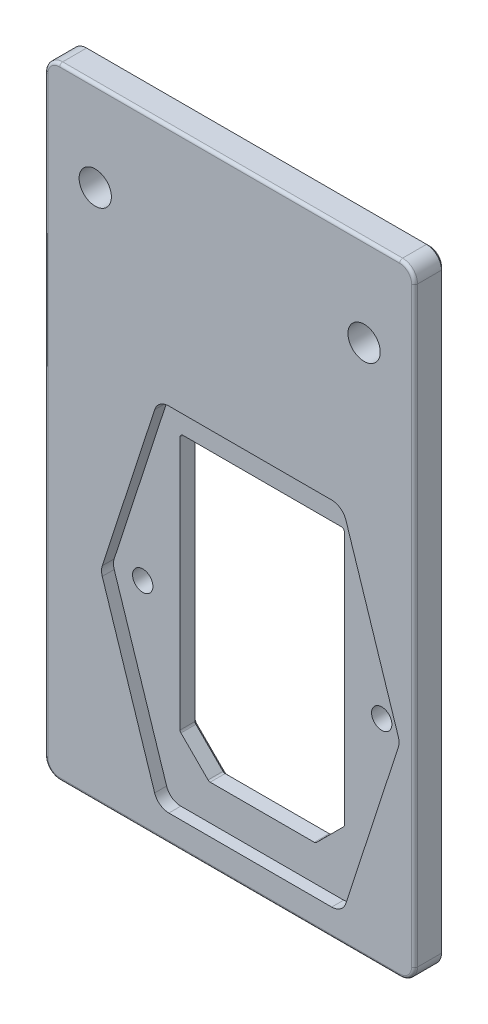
ISO-10303-21;
HEADER;
FILE_DESCRIPTION(('STEP AP214'),'2;1');
FILE_NAME('part.step','',(''),(''),'','','');
FILE_SCHEMA(('AUTOMOTIVE_DESIGN { 1 0 10303 214 1 1 1 1 }'));
ENDSEC;
DATA;
#1=APPLICATION_CONTEXT('core data for automotive mechanical design processes');
#2=APPLICATION_PROTOCOL_DEFINITION('international standard','automotive_design',2000,#1);
#3=PRODUCT_CONTEXT('',#1,'mechanical');
#4=PRODUCT('Part','Part','',(#3));
#5=PRODUCT_RELATED_PRODUCT_CATEGORY('part','',(#4));
#6=PRODUCT_DEFINITION_FORMATION('','',#4);
#7=PRODUCT_DEFINITION_CONTEXT('part definition',#1,'design');
#8=PRODUCT_DEFINITION('design','',#6,#7);
#9=PRODUCT_DEFINITION_SHAPE('','',#8);
#10=(LENGTH_UNIT() NAMED_UNIT(*) SI_UNIT(.MILLI.,.METRE.));
#11=(NAMED_UNIT(*) PLANE_ANGLE_UNIT() SI_UNIT($,.RADIAN.));
#12=(NAMED_UNIT(*) SI_UNIT($,.STERADIAN.) SOLID_ANGLE_UNIT());
#13=UNCERTAINTY_MEASURE_WITH_UNIT(LENGTH_MEASURE(1.E-05),#10,'distance_accuracy_value','');
#14=(GEOMETRIC_REPRESENTATION_CONTEXT(3) GLOBAL_UNCERTAINTY_ASSIGNED_CONTEXT((#13)) GLOBAL_UNIT_ASSIGNED_CONTEXT((#10,
#11,#12)) REPRESENTATION_CONTEXT('',''));
#15=CARTESIAN_POINT('',(0.,0.,0.));
#16=DIRECTION('',(0.,0.,1.));
#17=DIRECTION('',(1.,0.,0.));
#18=AXIS2_PLACEMENT_3D('',#15,#16,#17);
#19=CARTESIAN_POINT('',(-56.988915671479,13.9751421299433,5.));
#20=DIRECTION('',(-1.,0.,0.));
#21=DIRECTION('',(0.,0.,1.));
#22=AXIS2_PLACEMENT_3D('',#19,#20,#21);
#23=PLANE('',#22);
#24=DIRECTION('',(0.,0.,-1.));
#25=VECTOR('',#24,1.);
#26=CARTESIAN_POINT('',(-56.988915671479,56.6437523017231,0.));
#27=LINE('',#26,#25);
#28=CARTESIAN_POINT('',(-56.988915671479,56.6437523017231,3.));
#29=VERTEX_POINT('',#28);
#30=CARTESIAN_POINT('',(-56.988915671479,56.6437523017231,0.500000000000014));
#31=VERTEX_POINT('',#30);
#32=EDGE_CURVE('E647',#29,#31,#27,.T.);
#33=ORIENTED_EDGE('',*,*,#32,.T.);
#34=DIRECTION('',(0.,-1.,0.));
#35=VECTOR('',#34,1.);
#36=CARTESIAN_POINT('',(-56.988915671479,14.1822489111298,0.500000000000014));
#37=LINE('',#36,#35);
#38=CARTESIAN_POINT('',(-56.988915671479,14.1822489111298,0.500000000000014));
#39=VERTEX_POINT('',#38);
#40=EDGE_CURVE('E906',#31,#39,#37,.T.);
#41=ORIENTED_EDGE('',*,*,#40,.T.);
#42=DIRECTION('',(0.,0.,-1.));
#43=VECTOR('',#42,1.);
#44=CARTESIAN_POINT('',(-56.988915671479,14.1822489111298,3.));
#45=LINE('',#44,#43);
#46=CARTESIAN_POINT('',(-56.988915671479,14.1822489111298,3.));
#47=VERTEX_POINT('',#46);
#48=EDGE_CURVE('E651',#39,#47,#45,.F.);
#49=ORIENTED_EDGE('',*,*,#48,.T.);
#50=DIRECTION('',(0.,1.,0.));
#51=VECTOR('',#50,1.);
#52=CARTESIAN_POINT('',(-56.988915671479,13.9751421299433,3.));
#53=LINE('',#52,#51);
#54=EDGE_CURVE('E599',#47,#29,#53,.T.);
#55=ORIENTED_EDGE('',*,*,#54,.T.);
#56=EDGE_LOOP('',(#33,#41,#49,#55));
#57=FACE_BOUND('',#56,.T.);
#58=ADVANCED_FACE('F42',(#57),#23,.T.);
#59=CARTESIAN_POINT('',(-56.988915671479,57.1437523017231,5.));
#60=DIRECTION('',(0.,-1.,0.));
#61=DIRECTION('',(0.,0.,-1.));
#62=AXIS2_PLACEMENT_3D('',#59,#60,#61);
#63=PLANE('',#62);
#64=DIRECTION('',(0.,0.,-1.));
#65=VECTOR('',#64,1.);
#66=CARTESIAN_POINT('',(-83.988915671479,57.1437523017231,0.));
#67=LINE('',#66,#65);
#68=CARTESIAN_POINT('',(-83.988915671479,57.1437523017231,3.));
#69=VERTEX_POINT('',#68);
#70=CARTESIAN_POINT('',(-83.988915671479,57.1437523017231,0.500000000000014));
#71=VERTEX_POINT('',#70);
#72=EDGE_CURVE('E678',#69,#71,#67,.T.);
#73=ORIENTED_EDGE('',*,*,#72,.T.);
#74=DIRECTION('',(1.,0.,0.));
#75=VECTOR('',#74,1.);
#76=CARTESIAN_POINT('',(-57.488915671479,57.1437523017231,0.500000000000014));
#77=LINE('',#76,#75);
#78=CARTESIAN_POINT('',(-57.488915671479,57.1437523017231,0.500000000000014));
#79=VERTEX_POINT('',#78);
#80=EDGE_CURVE('E900',#71,#79,#77,.T.);
#81=ORIENTED_EDGE('',*,*,#80,.T.);
#82=DIRECTION('',(0.,0.,-1.));
#83=VECTOR('',#82,1.);
#84=CARTESIAN_POINT('',(-57.488915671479,57.1437523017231,3.));
#85=LINE('',#84,#83);
#86=CARTESIAN_POINT('',(-57.488915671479,57.1437523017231,3.));
#87=VERTEX_POINT('',#86);
#88=EDGE_CURVE('E675',#79,#87,#85,.F.);
#89=ORIENTED_EDGE('',*,*,#88,.T.);
#90=DIRECTION('',(-1.,0.,0.));
#91=VECTOR('',#90,1.);
#92=CARTESIAN_POINT('',(-56.988915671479,57.1437523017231,3.));
#93=LINE('',#92,#91);
#94=EDGE_CURVE('E595',#87,#69,#93,.T.);
#95=ORIENTED_EDGE('',*,*,#94,.T.);
#96=EDGE_LOOP('',(#73,#81,#89,#95));
#97=FACE_BOUND('',#96,.T.);
#98=ADVANCED_FACE('F1114',(#97),#63,.T.);
#99=CARTESIAN_POINT('',(-84.488915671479,57.1437523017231,5.));
#100=DIRECTION('',(1.,0.,0.));
#101=DIRECTION('',(0.,0.,-1.));
#102=AXIS2_PLACEMENT_3D('',#99,#100,#101);
#103=PLANE('',#102);
#104=DIRECTION('',(0.,0.,-1.));
#105=VECTOR('',#104,1.);
#106=CARTESIAN_POINT('',(-84.488915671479,14.18224891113,0.));
#107=LINE('',#106,#105);
#108=CARTESIAN_POINT('',(-84.488915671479,14.18224891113,3.));
#109=VERTEX_POINT('',#108);
#110=CARTESIAN_POINT('',(-84.488915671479,14.18224891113,0.500000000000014));
#111=VERTEX_POINT('',#110);
#112=EDGE_CURVE('E671',#109,#111,#107,.T.);
#113=ORIENTED_EDGE('',*,*,#112,.T.);
#114=DIRECTION('',(0.,1.,0.));
#115=VECTOR('',#114,1.);
#116=CARTESIAN_POINT('',(-84.488915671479,56.6437523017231,0.500000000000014));
#117=LINE('',#116,#115);
#118=CARTESIAN_POINT('',(-84.488915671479,56.6437523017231,0.500000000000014));
#119=VERTEX_POINT('',#118);
#120=EDGE_CURVE('E894',#111,#119,#117,.T.);
#121=ORIENTED_EDGE('',*,*,#120,.T.);
#122=DIRECTION('',(0.,0.,-1.));
#123=VECTOR('',#122,1.);
#124=CARTESIAN_POINT('',(-84.488915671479,56.6437523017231,3.));
#125=LINE('',#124,#123);
#126=CARTESIAN_POINT('',(-84.488915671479,56.6437523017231,3.));
#127=VERTEX_POINT('',#126);
#128=EDGE_CURVE('E668',#119,#127,#125,.F.);
#129=ORIENTED_EDGE('',*,*,#128,.T.);
#130=DIRECTION('',(0.,-1.,0.));
#131=VECTOR('',#130,1.);
#132=CARTESIAN_POINT('',(-84.488915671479,57.1437523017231,3.));
#133=LINE('',#132,#131);
#134=EDGE_CURVE('E591',#127,#109,#133,.T.);
#135=ORIENTED_EDGE('',*,*,#134,.T.);
#136=EDGE_LOOP('',(#113,#121,#129,#135));
#137=FACE_BOUND('',#136,.T.);
#138=ADVANCED_FACE('F1120',(#137),#103,.T.);
#139=CARTESIAN_POINT('',(-84.488915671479,13.9751421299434,5.));
#140=DIRECTION('',(0.707106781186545,0.707106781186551,0.));
#141=DIRECTION('',(-0.707106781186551,0.707106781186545,0.));
#142=AXIS2_PLACEMENT_3D('',#139,#140,#141);
#143=PLANE('',#142);
#144=DIRECTION('',(0.,0.,-1.));
#145=VECTOR('',#144,1.);
#146=CARTESIAN_POINT('',(-79.8039724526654,9.29019891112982,0.));
#147=LINE('',#146,#145);
#148=CARTESIAN_POINT('',(-79.8039724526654,9.29019891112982,3.));
#149=VERTEX_POINT('',#148);
#150=CARTESIAN_POINT('',(-79.8039724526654,9.29019891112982,0.500000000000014));
#151=VERTEX_POINT('',#150);
#152=EDGE_CURVE('E664',#149,#151,#147,.T.);
#153=ORIENTED_EDGE('',*,*,#152,.T.);
#154=DIRECTION('',(-0.707106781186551,0.707106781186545,0.));
#155=VECTOR('',#154,1.);
#156=CARTESIAN_POINT('',(-84.3424690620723,13.8286955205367,0.500000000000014));
#157=LINE('',#156,#155);
#158=CARTESIAN_POINT('',(-84.3424690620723,13.8286955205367,0.500000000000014));
#159=VERTEX_POINT('',#158);
#160=EDGE_CURVE('E888',#151,#159,#157,.T.);
#161=ORIENTED_EDGE('',*,*,#160,.T.);
#162=DIRECTION('',(0.,0.,-1.));
#163=VECTOR('',#162,1.);
#164=CARTESIAN_POINT('',(-84.3424690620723,13.8286955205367,3.));
#165=LINE('',#164,#163);
#166=CARTESIAN_POINT('',(-84.3424690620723,13.8286955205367,3.));
#167=VERTEX_POINT('',#166);
#168=EDGE_CURVE('E661',#159,#167,#165,.F.);
#169=ORIENTED_EDGE('',*,*,#168,.T.);
#170=DIRECTION('',(0.707106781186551,-0.707106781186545,0.));
#171=VECTOR('',#170,1.);
#172=CARTESIAN_POINT('',(-84.488915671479,13.9751421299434,3.));
#173=LINE('',#172,#171);
#174=EDGE_CURVE('E587',#167,#149,#173,.T.);
#175=ORIENTED_EDGE('',*,*,#174,.T.);
#176=EDGE_LOOP('',(#153,#161,#169,#175));
#177=FACE_BOUND('',#176,.T.);
#178=ADVANCED_FACE('F1638',(#177),#143,.T.);
#179=CARTESIAN_POINT('',(-79.6575258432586,9.1437523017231,5.));
#180=DIRECTION('',(0.,1.,0.));
#181=DIRECTION('',(-1.,0.,0.));
#182=AXIS2_PLACEMENT_3D('',#179,#180,#181);
#183=PLANE('',#182);
#184=DIRECTION('',(0.,0.,-1.));
#185=VECTOR('',#184,1.);
#186=CARTESIAN_POINT('',(-62.0274122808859,9.14375230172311,0.));
#187=LINE('',#186,#185);
#188=CARTESIAN_POINT('',(-62.0274122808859,9.14375230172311,3.));
#189=VERTEX_POINT('',#188);
#190=CARTESIAN_POINT('',(-62.0274122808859,9.14375230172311,0.500000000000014));
#191=VERTEX_POINT('',#190);
#192=EDGE_CURVE('E657',#189,#191,#187,.T.);
#193=ORIENTED_EDGE('',*,*,#192,.T.);
#194=DIRECTION('',(-1.,0.,0.));
#195=VECTOR('',#194,1.);
#196=CARTESIAN_POINT('',(-79.4504190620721,9.1437523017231,0.500000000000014));
#197=LINE('',#196,#195);
#198=CARTESIAN_POINT('',(-79.4504190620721,9.1437523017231,0.500000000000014));
#199=VERTEX_POINT('',#198);
#200=EDGE_CURVE('E882',#191,#199,#197,.T.);
#201=ORIENTED_EDGE('',*,*,#200,.T.);
#202=DIRECTION('',(0.,0.,-1.));
#203=VECTOR('',#202,1.);
#204=CARTESIAN_POINT('',(-79.4504190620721,9.1437523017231,3.));
#205=LINE('',#204,#203);
#206=CARTESIAN_POINT('',(-79.4504190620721,9.1437523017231,3.));
#207=VERTEX_POINT('',#206);
#208=EDGE_CURVE('E654',#199,#207,#205,.F.);
#209=ORIENTED_EDGE('',*,*,#208,.T.);
#210=DIRECTION('',(1.,0.,0.));
#211=VECTOR('',#210,1.);
#212=CARTESIAN_POINT('',(-79.6575258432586,9.1437523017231,3.));
#213=LINE('',#212,#211);
#214=EDGE_CURVE('E583',#207,#189,#213,.T.);
#215=ORIENTED_EDGE('',*,*,#214,.T.);
#216=EDGE_LOOP('',(#193,#201,#209,#215));
#217=FACE_BOUND('',#216,.T.);
#218=ADVANCED_FACE('F1630',(#217),#183,.T.);
#219=CARTESIAN_POINT('',(-61.8203054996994,9.14375230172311,5.));
#220=DIRECTION('',(-0.707106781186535,0.70710678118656,0.));
#221=DIRECTION('',(-0.70710678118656,-0.707106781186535,0.));
#222=AXIS2_PLACEMENT_3D('',#219,#220,#221);
#223=PLANE('',#222);
#224=DIRECTION('',(0.,0.,-1.));
#225=VECTOR('',#224,1.);
#226=CARTESIAN_POINT('',(-57.1353622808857,13.8286955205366,0.));
#227=LINE('',#226,#225);
#228=CARTESIAN_POINT('',(-57.1353622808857,13.8286955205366,3.));
#229=VERTEX_POINT('',#228);
#230=CARTESIAN_POINT('',(-57.1353622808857,13.8286955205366,0.500000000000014));
#231=VERTEX_POINT('',#230);
#232=EDGE_CURVE('E643',#229,#231,#227,.T.);
#233=ORIENTED_EDGE('',*,*,#232,.T.);
#234=DIRECTION('',(-0.70710678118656,-0.707106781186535,0.));
#235=VECTOR('',#234,1.);
#236=CARTESIAN_POINT('',(-61.6738588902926,9.29019891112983,0.500000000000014));
#237=LINE('',#236,#235);
#238=CARTESIAN_POINT('',(-61.6738588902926,9.29019891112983,0.500000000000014));
#239=VERTEX_POINT('',#238);
#240=EDGE_CURVE('E912',#231,#239,#237,.T.);
#241=ORIENTED_EDGE('',*,*,#240,.T.);
#242=DIRECTION('',(0.,0.,-1.));
#243=VECTOR('',#242,1.);
#244=CARTESIAN_POINT('',(-61.6738588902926,9.29019891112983,3.));
#245=LINE('',#244,#243);
#246=CARTESIAN_POINT('',(-61.6738588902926,9.29019891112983,3.));
#247=VERTEX_POINT('',#246);
#248=EDGE_CURVE('E640',#239,#247,#245,.F.);
#249=ORIENTED_EDGE('',*,*,#248,.T.);
#250=DIRECTION('',(0.70710678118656,0.707106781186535,0.));
#251=VECTOR('',#250,1.);
#252=CARTESIAN_POINT('',(-61.8203054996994,9.14375230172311,3.));
#253=LINE('',#252,#251);
#254=EDGE_CURVE('E579',#247,#229,#253,.T.);
#255=ORIENTED_EDGE('',*,*,#254,.T.);
#256=EDGE_LOOP('',(#233,#241,#249,#255));
#257=FACE_BOUND('',#256,.T.);
#258=ADVANCED_FACE('F1622',(#257),#223,.T.);
#259=CARTESIAN_POINT('',(-90.7389104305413,32.7119498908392,5.));
#260=DIRECTION('',(0.,0.,-1.));
#261=DIRECTION('',(-1.,0.,0.));
#262=AXIS2_PLACEMENT_3D('',#259,#260,#261);
#263=CYLINDRICAL_SURFACE('',#262,1.70000000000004);
#264=CARTESIAN_POINT('',(-90.7389104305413,32.7119498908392,0.500000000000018));
#265=DIRECTION('',(0.,0.,1.));
#266=DIRECTION('',(1.,0.,0.));
#267=AXIS2_PLACEMENT_3D('',#264,#265,#266);
#268=CIRCLE('',#267,1.70000000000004);
#269=CARTESIAN_POINT('',(-89.0389104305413,32.7119498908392,0.500000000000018));
#270=VERTEX_POINT('',#269);
#271=EDGE_CURVE('E866',#270,#270,#268,.F.);
#272=ORIENTED_EDGE('',*,*,#271,.T.);
#273=EDGE_LOOP('',(#272));
#274=FACE_BOUND('',#273,.T.);
#275=CARTESIAN_POINT('',(-90.7389104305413,32.7119498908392,3.));
#276=DIRECTION('',(0.,0.,1.));
#277=DIRECTION('',(1.,0.,0.));
#278=AXIS2_PLACEMENT_3D('',#275,#276,#277);
#279=CIRCLE('',#278,1.70000000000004);
#280=CARTESIAN_POINT('',(-89.0389104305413,32.7119498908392,3.));
#281=VERTEX_POINT('',#280);
#282=EDGE_CURVE('E576',#281,#281,#279,.T.);
#283=ORIENTED_EDGE('',*,*,#282,.T.);
#284=EDGE_LOOP('',(#283));
#285=FACE_BOUND('',#284,.T.);
#286=ADVANCED_FACE('F1614',(#274,#285),#263,.F.);
#287=CARTESIAN_POINT('',(-50.7389209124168,32.7119498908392,5.));
#288=DIRECTION('',(0.,0.,-1.));
#289=DIRECTION('',(-1.,0.,0.));
#290=AXIS2_PLACEMENT_3D('',#287,#288,#289);
#291=CYLINDRICAL_SURFACE('',#290,1.69999999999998);
#292=CARTESIAN_POINT('',(-50.7389209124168,32.7119498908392,0.500000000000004));
#293=DIRECTION('',(0.,0.,1.));
#294=DIRECTION('',(1.,0.,0.));
#295=AXIS2_PLACEMENT_3D('',#292,#293,#294);
#296=CIRCLE('',#295,1.69999999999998);
#297=CARTESIAN_POINT('',(-49.0389209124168,32.7119498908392,0.500000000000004));
#298=VERTEX_POINT('',#297);
#299=EDGE_CURVE('E862',#298,#298,#296,.F.);
#300=ORIENTED_EDGE('',*,*,#299,.T.);
#301=EDGE_LOOP('',(#300));
#302=FACE_BOUND('',#301,.T.);
#303=CARTESIAN_POINT('',(-50.7389209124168,32.7119498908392,3.));
#304=DIRECTION('',(0.,0.,1.));
#305=DIRECTION('',(1.,0.,0.));
#306=AXIS2_PLACEMENT_3D('',#303,#304,#305);
#307=CIRCLE('',#306,1.69999999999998);
#308=CARTESIAN_POINT('',(-49.0389209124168,32.7119498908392,3.));
#309=VERTEX_POINT('',#308);
#310=EDGE_CURVE('E546',#309,#309,#307,.T.);
#311=ORIENTED_EDGE('',*,*,#310,.T.);
#312=EDGE_LOOP('',(#311));
#313=FACE_BOUND('',#312,.T.);
#314=ADVANCED_FACE('F1127',(#302,#313),#291,.F.);
#315=CARTESIAN_POINT('',(0.,0.,5.));
#316=DIRECTION('',(0.,0.,1.));
#317=DIRECTION('',(1.,0.,0.));
#318=AXIS2_PLACEMENT_3D('',#315,#316,#317);
#319=PLANE('',#318);
#320=DIRECTION('',(0.,1.,0.));
#321=VECTOR('',#320,1.);
#322=CARTESIAN_POINT('',(-43.7389209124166,100.211952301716,5.));
#323=LINE('',#322,#321);
#324=CARTESIAN_POINT('',(-43.7389209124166,1.21195230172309,5.));
#325=VERTEX_POINT('',#324);
#326=CARTESIAN_POINT('',(-43.7389209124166,100.211952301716,5.));
#327=VERTEX_POINT('',#326);
#328=EDGE_CURVE('E718',#325,#327,#323,.T.);
#329=ORIENTED_EDGE('',*,*,#328,.T.);
#330=CARTESIAN_POINT('',(-45.7389209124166,100.211952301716,5.));
#331=DIRECTION('',(0.,0.,1.));
#332=DIRECTION('',(1.,0.,0.));
#333=AXIS2_PLACEMENT_3D('',#330,#331,#332);
#334=CIRCLE('',#333,2.);
#335=CARTESIAN_POINT('',(-45.7389209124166,102.211952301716,5.));
#336=VERTEX_POINT('',#335);
#337=EDGE_CURVE('E721',#327,#336,#334,.T.);
#338=ORIENTED_EDGE('',*,*,#337,.T.);
#339=DIRECTION('',(-1.,0.,0.));
#340=VECTOR('',#339,1.);
#341=CARTESIAN_POINT('',(-102.63606964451,102.211952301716,5.));
#342=LINE('',#341,#340);
#343=CARTESIAN_POINT('',(-102.63606964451,102.211952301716,5.));
#344=VERTEX_POINT('',#343);
#345=EDGE_CURVE('E700',#336,#344,#342,.T.);
#346=ORIENTED_EDGE('',*,*,#345,.T.);
#347=CARTESIAN_POINT('',(-102.63606964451,100.211952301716,5.));
#348=DIRECTION('',(0.,0.,1.));
#349=DIRECTION('',(1.,0.,0.));
#350=AXIS2_PLACEMENT_3D('',#347,#348,#349);
#351=CIRCLE('',#350,2.);
#352=CARTESIAN_POINT('',(-104.63606964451,100.211952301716,5.));
#353=VERTEX_POINT('',#352);
#354=EDGE_CURVE('E703',#344,#353,#351,.T.);
#355=ORIENTED_EDGE('',*,*,#354,.T.);
#356=DIRECTION('',(0.,-1.,0.));
#357=VECTOR('',#356,1.);
#358=CARTESIAN_POINT('',(-104.63606964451,1.21195230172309,5.));
#359=LINE('',#358,#357);
#360=CARTESIAN_POINT('',(-104.63606964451,1.21195230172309,5.));
#361=VERTEX_POINT('',#360);
#362=EDGE_CURVE('E706',#353,#361,#359,.T.);
#363=ORIENTED_EDGE('',*,*,#362,.T.);
#364=CARTESIAN_POINT('',(-102.63606964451,1.21195230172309,5.));
#365=DIRECTION('',(0.,0.,1.));
#366=DIRECTION('',(1.,0.,0.));
#367=AXIS2_PLACEMENT_3D('',#364,#365,#366);
#368=CIRCLE('',#367,2.);
#369=CARTESIAN_POINT('',(-102.63606964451,-0.788047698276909,5.));
#370=VERTEX_POINT('',#369);
#371=EDGE_CURVE('E709',#361,#370,#368,.T.);
#372=ORIENTED_EDGE('',*,*,#371,.T.);
#373=DIRECTION('',(1.,0.,0.));
#374=VECTOR('',#373,1.);
#375=CARTESIAN_POINT('',(-45.7389209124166,-0.788047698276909,5.));
#376=LINE('',#375,#374);
#377=CARTESIAN_POINT('',(-45.7389209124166,-0.788047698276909,5.));
#378=VERTEX_POINT('',#377);
#379=EDGE_CURVE('E712',#370,#378,#376,.T.);
#380=ORIENTED_EDGE('',*,*,#379,.T.);
#381=CARTESIAN_POINT('',(-45.7389209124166,1.21195230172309,5.));
#382=DIRECTION('',(0.,0.,1.));
#383=DIRECTION('',(1.,0.,0.));
#384=AXIS2_PLACEMENT_3D('',#381,#382,#383);
#385=CIRCLE('',#384,2.);
#386=EDGE_CURVE('E715',#378,#325,#385,.T.);
#387=ORIENTED_EDGE('',*,*,#386,.T.);
#388=EDGE_LOOP('',(#329,#338,#346,#355,#363,#372,#380,#387));
#389=FACE_BOUND('',#388,.T.);
#390=CARTESIAN_POINT('',(-93.1360696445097,32.7119523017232,5.));
#391=DIRECTION('',(0.,0.,1.));
#392=DIRECTION('',(1.,0.,0.));
#393=AXIS2_PLACEMENT_3D('',#390,#391,#392);
#394=CIRCLE('',#393,2.49999999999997);
#395=CARTESIAN_POINT('',(-95.5138055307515,33.4842035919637,5.));
#396=VERTEX_POINT('',#395);
#397=CARTESIAN_POINT('',(-95.5138055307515,31.9397010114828,5.));
#398=VERTEX_POINT('',#397);
#399=EDGE_CURVE('E438',#396,#398,#394,.T.);
#400=ORIENTED_EDGE('',*,*,#399,.F.);
#401=DIRECTION('',(-0.308900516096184,-0.951094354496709,0.));
#402=VECTOR('',#401,1.);
#403=CARTESIAN_POINT('',(-86.7446293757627,60.4842035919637,5.));
#404=LINE('',#403,#402);
#405=CARTESIAN_POINT('',(-86.7446293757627,60.4842035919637,5.));
#406=VERTEX_POINT('',#405);
#407=EDGE_CURVE('E459',#406,#396,#404,.T.);
#408=ORIENTED_EDGE('',*,*,#407,.F.);
#409=CARTESIAN_POINT('',(-84.3668934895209,59.7119523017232,5.));
#410=DIRECTION('',(0.,0.,1.));
#411=DIRECTION('',(1.,0.,0.));
#412=AXIS2_PLACEMENT_3D('',#409,#410,#411);
#413=CIRCLE('',#412,2.5);
#414=CARTESIAN_POINT('',(-84.3668934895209,62.2119523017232,5.));
#415=VERTEX_POINT('',#414);
#416=EDGE_CURVE('E465',#415,#406,#413,.T.);
#417=ORIENTED_EDGE('',*,*,#416,.F.);
#418=DIRECTION('',(-1.,0.,0.));
#419=VECTOR('',#418,1.);
#420=CARTESIAN_POINT('',(-57.1109378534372,62.2119523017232,5.));
#421=LINE('',#420,#419);
#422=CARTESIAN_POINT('',(-57.1109378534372,62.2119523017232,5.));
#423=VERTEX_POINT('',#422);
#424=EDGE_CURVE('E536',#423,#415,#421,.T.);
#425=ORIENTED_EDGE('',*,*,#424,.F.);
#426=CARTESIAN_POINT('',(-57.1109378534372,59.7119523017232,5.));
#427=DIRECTION('',(0.,0.,1.));
#428=DIRECTION('',(1.,0.,0.));
#429=AXIS2_PLACEMENT_3D('',#426,#427,#428);
#430=CIRCLE('',#429,2.49999999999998);
#431=CARTESIAN_POINT('',(-54.7332019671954,60.4842035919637,5.));
#432=VERTEX_POINT('',#431);
#433=EDGE_CURVE('E532',#432,#423,#430,.T.);
#434=ORIENTED_EDGE('',*,*,#433,.F.);
#435=DIRECTION('',(-0.308900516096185,0.951094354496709,0.));
#436=VECTOR('',#435,1.);
#437=CARTESIAN_POINT('',(-45.9640258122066,33.4842035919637,5.));
#438=LINE('',#437,#436);
#439=CARTESIAN_POINT('',(-45.9640258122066,33.4842035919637,5.));
#440=VERTEX_POINT('',#439);
#441=EDGE_CURVE('E528',#440,#432,#438,.T.);
#442=ORIENTED_EDGE('',*,*,#441,.F.);
#443=CARTESIAN_POINT('',(-48.3417616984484,32.7119523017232,5.));
#444=DIRECTION('',(0.,0.,1.));
#445=DIRECTION('',(1.,0.,0.));
#446=AXIS2_PLACEMENT_3D('',#443,#444,#445);
#447=CIRCLE('',#446,2.49999999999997);
#448=CARTESIAN_POINT('',(-45.9640258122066,31.9397010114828,5.));
#449=VERTEX_POINT('',#448);
#450=EDGE_CURVE('E524',#449,#440,#447,.T.);
#451=ORIENTED_EDGE('',*,*,#450,.F.);
#452=DIRECTION('',(0.308900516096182,0.95109435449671,0.));
#453=VECTOR('',#452,1.);
#454=CARTESIAN_POINT('',(-54.7332019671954,4.93970101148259,5.));
#455=LINE('',#454,#453);
#456=CARTESIAN_POINT('',(-54.7332019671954,4.93970101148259,5.));
#457=VERTEX_POINT('',#456);
#458=EDGE_CURVE('E520',#457,#449,#455,.T.);
#459=ORIENTED_EDGE('',*,*,#458,.F.);
#460=CARTESIAN_POINT('',(-57.1109378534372,5.7119523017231,5.));
#461=DIRECTION('',(0.,0.,1.));
#462=DIRECTION('',(1.,0.,0.));
#463=AXIS2_PLACEMENT_3D('',#460,#461,#462);
#464=CIRCLE('',#463,2.50000000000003);
#465=CARTESIAN_POINT('',(-57.1109378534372,3.21195230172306,5.));
#466=VERTEX_POINT('',#465);
#467=EDGE_CURVE('E516',#466,#457,#464,.T.);
#468=ORIENTED_EDGE('',*,*,#467,.F.);
#469=DIRECTION('',(1.,0.,0.));
#470=VECTOR('',#469,1.);
#471=CARTESIAN_POINT('',(-84.3668934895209,3.21195230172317,5.));
#472=LINE('',#471,#470);
#473=CARTESIAN_POINT('',(-84.3668934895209,3.21195230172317,5.));
#474=VERTEX_POINT('',#473);
#475=EDGE_CURVE('E512',#474,#466,#472,.T.);
#476=ORIENTED_EDGE('',*,*,#475,.F.);
#477=CARTESIAN_POINT('',(-84.3668934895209,5.71195230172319,5.));
#478=DIRECTION('',(0.,0.,1.));
#479=DIRECTION('',(1.,0.,0.));
#480=AXIS2_PLACEMENT_3D('',#477,#478,#479);
#481=CIRCLE('',#480,2.50000000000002);
#482=CARTESIAN_POINT('',(-86.7446293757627,4.93970101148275,5.));
#483=VERTEX_POINT('',#482);
#484=EDGE_CURVE('E508',#483,#474,#481,.T.);
#485=ORIENTED_EDGE('',*,*,#484,.F.);
#486=DIRECTION('',(0.308900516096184,-0.951094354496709,0.));
#487=VECTOR('',#486,1.);
#488=CARTESIAN_POINT('',(-95.5138055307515,31.9397010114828,5.));
#489=LINE('',#488,#487);
#490=EDGE_CURVE('E504',#398,#483,#489,.T.);
#491=ORIENTED_EDGE('',*,*,#490,.F.);
#492=EDGE_LOOP('',(#400,#408,#417,#425,#434,#442,#451,#459,#468,#476,#485,#491));
#493=FACE_BOUND('',#492,.T.);
#494=CARTESIAN_POINT('',(-96.6874952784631,87.7119523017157,5.));
#495=DIRECTION('',(0.,0.,1.));
#496=DIRECTION('',(1.,0.,0.));
#497=AXIS2_PLACEMENT_3D('',#494,#495,#496);
#498=CIRCLE('',#497,2.70000000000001);
#499=CARTESIAN_POINT('',(-93.9874952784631,87.7119523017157,5.));
#500=VERTEX_POINT('',#499);
#501=EDGE_CURVE('E607',#500,#500,#498,.T.);
#502=ORIENTED_EDGE('',*,*,#501,.F.);
#503=EDGE_LOOP('',(#502));
#504=FACE_BOUND('',#503,.T.);
#505=CARTESIAN_POINT('',(-51.6874952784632,87.7119523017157,5.));
#506=DIRECTION('',(0.,0.,1.));
#507=DIRECTION('',(1.,0.,0.));
#508=AXIS2_PLACEMENT_3D('',#505,#506,#507);
#509=CIRCLE('',#508,2.69999999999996);
#510=CARTESIAN_POINT('',(-48.9874952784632,87.7119523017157,5.));
#511=VERTEX_POINT('',#510);
#512=EDGE_CURVE('E603',#511,#511,#509,.T.);
#513=ORIENTED_EDGE('',*,*,#512,.F.);
#514=EDGE_LOOP('',(#513));
#515=FACE_BOUND('',#514,.T.);
#516=ADVANCED_FACE('F1044',(#389,#493,#504,#515),#319,.T.);
#517=CARTESIAN_POINT('',(0.,0.,0.));
#518=DIRECTION('',(0.,0.,1.));
#519=DIRECTION('',(1.,0.,0.));
#520=AXIS2_PLACEMENT_3D('',#517,#518,#519);
#521=PLANE('',#520);
#522=CARTESIAN_POINT('',(-50.7389209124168,32.7119498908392,0.));
#523=DIRECTION('',(0.,0.,1.));
#524=DIRECTION('',(1.,0.,0.));
#525=AXIS2_PLACEMENT_3D('',#522,#523,#524);
#526=CIRCLE('',#525,2.19999999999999);
#527=CARTESIAN_POINT('',(-48.5389209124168,32.7119498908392,0.));
#528=VERTEX_POINT('',#527);
#529=EDGE_CURVE('E858',#528,#528,#526,.T.);
#530=ORIENTED_EDGE('',*,*,#529,.T.);
#531=EDGE_LOOP('',(#530));
#532=FACE_BOUND('',#531,.T.);
#533=CARTESIAN_POINT('',(-90.7389104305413,32.7119498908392,0.));
#534=DIRECTION('',(0.,0.,1.));
#535=DIRECTION('',(1.,0.,0.));
#536=AXIS2_PLACEMENT_3D('',#533,#534,#535);
#537=CIRCLE('',#536,2.20000000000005);
#538=CARTESIAN_POINT('',(-88.5389104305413,32.7119498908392,0.));
#539=VERTEX_POINT('',#538);
#540=EDGE_CURVE('E854',#539,#539,#537,.T.);
#541=ORIENTED_EDGE('',*,*,#540,.T.);
#542=EDGE_LOOP('',(#541));
#543=FACE_BOUND('',#542,.T.);
#544=CARTESIAN_POINT('',(-51.6874952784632,87.7119523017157,0.));
#545=DIRECTION('',(0.,0.,1.));
#546=DIRECTION('',(1.,0.,0.));
#547=AXIS2_PLACEMENT_3D('',#544,#545,#546);
#548=CIRCLE('',#547,3.19999999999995);
#549=CARTESIAN_POINT('',(-48.4874952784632,87.7119523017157,0.));
#550=VERTEX_POINT('',#549);
#551=EDGE_CURVE('E850',#550,#550,#548,.T.);
#552=ORIENTED_EDGE('',*,*,#551,.T.);
#553=EDGE_LOOP('',(#552));
#554=FACE_BOUND('',#553,.T.);
#555=CARTESIAN_POINT('',(-96.6874952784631,87.7119523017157,0.));
#556=DIRECTION('',(0.,0.,1.));
#557=DIRECTION('',(1.,0.,0.));
#558=AXIS2_PLACEMENT_3D('',#555,#556,#557);
#559=CIRCLE('',#558,3.20000000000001);
#560=CARTESIAN_POINT('',(-93.4874952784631,87.7119523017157,0.));
#561=VERTEX_POINT('',#560);
#562=EDGE_CURVE('E846',#561,#561,#559,.T.);
#563=ORIENTED_EDGE('',*,*,#562,.T.);
#564=EDGE_LOOP('',(#563));
#565=FACE_BOUND('',#564,.T.);
#566=DIRECTION('',(1.,0.,0.));
#567=VECTOR('',#566,1.);
#568=CARTESIAN_POINT('',(-62.0274122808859,8.64375230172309,0.));
#569=LINE('',#568,#567);
#570=CARTESIAN_POINT('',(-79.4504190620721,8.64375230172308,0.));
#571=VERTEX_POINT('',#570);
#572=CARTESIAN_POINT('',(-62.0274122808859,8.64375230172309,0.));
#573=VERTEX_POINT('',#572);
#574=EDGE_CURVE('E839',#571,#573,#569,.T.);
#575=ORIENTED_EDGE('',*,*,#574,.T.);
#576=CARTESIAN_POINT('',(-62.0274122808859,9.64375230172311,0.));
#577=DIRECTION('',(0.,0.,1.));
#578=DIRECTION('',(1.,0.,0.));
#579=AXIS2_PLACEMENT_3D('',#576,#577,#578);
#580=CIRCLE('',#579,1.00000000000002);
#581=CARTESIAN_POINT('',(-61.3203054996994,8.93664552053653,0.));
#582=VERTEX_POINT('',#581);
#583=EDGE_CURVE('E842',#573,#582,#580,.T.);
#584=ORIENTED_EDGE('',*,*,#583,.T.);
#585=DIRECTION('',(0.70710678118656,0.707106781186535,0.));
#586=VECTOR('',#585,1.);
#587=CARTESIAN_POINT('',(-56.7818088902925,13.4751421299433,0.));
#588=LINE('',#587,#586);
#589=CARTESIAN_POINT('',(-56.7818088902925,13.4751421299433,0.));
#590=VERTEX_POINT('',#589);
#591=EDGE_CURVE('E809',#582,#590,#588,.T.);
#592=ORIENTED_EDGE('',*,*,#591,.T.);
#593=CARTESIAN_POINT('',(-57.488915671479,14.1822489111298,0.));
#594=DIRECTION('',(0.,0.,1.));
#595=DIRECTION('',(1.,0.,0.));
#596=AXIS2_PLACEMENT_3D('',#593,#594,#595);
#597=CIRCLE('',#596,1.00000000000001);
#598=CARTESIAN_POINT('',(-56.488915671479,14.1822489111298,0.));
#599=VERTEX_POINT('',#598);
#600=EDGE_CURVE('E812',#590,#599,#597,.T.);
#601=ORIENTED_EDGE('',*,*,#600,.T.);
#602=DIRECTION('',(0.,1.,0.));
#603=VECTOR('',#602,1.);
#604=CARTESIAN_POINT('',(-56.488915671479,56.6437523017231,0.));
#605=LINE('',#604,#603);
#606=CARTESIAN_POINT('',(-56.488915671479,56.6437523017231,0.));
#607=VERTEX_POINT('',#606);
#608=EDGE_CURVE('E815',#599,#607,#605,.T.);
#609=ORIENTED_EDGE('',*,*,#608,.T.);
#610=CARTESIAN_POINT('',(-57.488915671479,56.6437523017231,0.));
#611=DIRECTION('',(0.,0.,1.));
#612=DIRECTION('',(1.,0.,0.));
#613=AXIS2_PLACEMENT_3D('',#610,#611,#612);
#614=CIRCLE('',#613,1.00000000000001);
#615=CARTESIAN_POINT('',(-57.488915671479,57.6437523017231,0.));
#616=VERTEX_POINT('',#615);
#617=EDGE_CURVE('E818',#607,#616,#614,.T.);
#618=ORIENTED_EDGE('',*,*,#617,.T.);
#619=DIRECTION('',(-1.,0.,0.));
#620=VECTOR('',#619,1.);
#621=CARTESIAN_POINT('',(-83.988915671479,57.6437523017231,0.));
#622=LINE('',#621,#620);
#623=CARTESIAN_POINT('',(-83.988915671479,57.6437523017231,0.));
#624=VERTEX_POINT('',#623);
#625=EDGE_CURVE('E821',#616,#624,#622,.T.);
#626=ORIENTED_EDGE('',*,*,#625,.T.);
#627=CARTESIAN_POINT('',(-83.988915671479,56.6437523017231,0.));
#628=DIRECTION('',(0.,0.,1.));
#629=DIRECTION('',(1.,0.,0.));
#630=AXIS2_PLACEMENT_3D('',#627,#628,#629);
#631=CIRCLE('',#630,1.00000000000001);
#632=CARTESIAN_POINT('',(-84.988915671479,56.6437523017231,0.));
#633=VERTEX_POINT('',#632);
#634=EDGE_CURVE('E824',#624,#633,#631,.T.);
#635=ORIENTED_EDGE('',*,*,#634,.T.);
#636=DIRECTION('',(0.,-1.,0.));
#637=VECTOR('',#636,1.);
#638=CARTESIAN_POINT('',(-84.988915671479,14.18224891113,0.));
#639=LINE('',#638,#637);
#640=CARTESIAN_POINT('',(-84.988915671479,14.18224891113,0.));
#641=VERTEX_POINT('',#640);
#642=EDGE_CURVE('E827',#633,#641,#639,.T.);
#643=ORIENTED_EDGE('',*,*,#642,.T.);
#644=CARTESIAN_POINT('',(-83.988915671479,14.18224891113,0.));
#645=DIRECTION('',(0.,0.,1.));
#646=DIRECTION('',(1.,0.,0.));
#647=AXIS2_PLACEMENT_3D('',#644,#645,#646);
#648=CIRCLE('',#647,1.00000000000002);
#649=CARTESIAN_POINT('',(-84.6960224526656,13.4751421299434,0.));
#650=VERTEX_POINT('',#649);
#651=EDGE_CURVE('E830',#641,#650,#648,.T.);
#652=ORIENTED_EDGE('',*,*,#651,.T.);
#653=DIRECTION('',(0.707106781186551,-0.707106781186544,0.));
#654=VECTOR('',#653,1.);
#655=CARTESIAN_POINT('',(-80.1575258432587,8.93664552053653,0.));
#656=LINE('',#655,#654);
#657=CARTESIAN_POINT('',(-80.1575258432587,8.93664552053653,0.));
#658=VERTEX_POINT('',#657);
#659=EDGE_CURVE('E833',#650,#658,#656,.T.);
#660=ORIENTED_EDGE('',*,*,#659,.T.);
#661=CARTESIAN_POINT('',(-79.4504190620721,9.6437523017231,0.));
#662=DIRECTION('',(0.,0.,1.));
#663=DIRECTION('',(1.,0.,0.));
#664=AXIS2_PLACEMENT_3D('',#661,#662,#663);
#665=CIRCLE('',#664,1.00000000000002);
#666=EDGE_CURVE('E836',#658,#571,#665,.T.);
#667=ORIENTED_EDGE('',*,*,#666,.T.);
#668=EDGE_LOOP('',(#575,#584,#592,#601,#609,#618,#626,#635,#643,#652,#660,#667));
#669=FACE_BOUND('',#668,.T.);
#670=DIRECTION('',(0.,1.,0.));
#671=VECTOR('',#670,1.);
#672=CARTESIAN_POINT('',(-104.63606964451,0.,0.));
#673=LINE('',#672,#671);
#674=CARTESIAN_POINT('',(-104.63606964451,1.21195230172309,0.));
#675=VERTEX_POINT('',#674);
#676=CARTESIAN_POINT('',(-104.63606964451,100.211952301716,0.));
#677=VERTEX_POINT('',#676);
#678=EDGE_CURVE('E802',#675,#677,#673,.T.);
#679=ORIENTED_EDGE('',*,*,#678,.T.);
#680=CARTESIAN_POINT('',(-102.63606964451,100.211952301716,0.));
#681=DIRECTION('',(0.,0.,1.));
#682=DIRECTION('',(1.,0.,0.));
#683=AXIS2_PLACEMENT_3D('',#680,#681,#682);
#684=CIRCLE('',#683,2.);
#685=CARTESIAN_POINT('',(-102.63606964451,102.211952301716,0.));
#686=VERTEX_POINT('',#685);
#687=EDGE_CURVE('E805',#677,#686,#684,.F.);
#688=ORIENTED_EDGE('',*,*,#687,.T.);
#689=DIRECTION('',(1.,0.,0.));
#690=VECTOR('',#689,1.);
#691=CARTESIAN_POINT('',(0.,102.211952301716,0.));
#692=LINE('',#691,#690);
#693=CARTESIAN_POINT('',(-45.7389209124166,102.211952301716,0.));
#694=VERTEX_POINT('',#693);
#695=EDGE_CURVE('E753',#686,#694,#692,.T.);
#696=ORIENTED_EDGE('',*,*,#695,.T.);
#697=CARTESIAN_POINT('',(-45.7389209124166,100.211952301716,0.));
#698=DIRECTION('',(0.,0.,1.));
#699=DIRECTION('',(1.,0.,0.));
#700=AXIS2_PLACEMENT_3D('',#697,#698,#699);
#701=CIRCLE('',#700,2.);
#702=CARTESIAN_POINT('',(-43.7389209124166,100.211952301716,0.));
#703=VERTEX_POINT('',#702);
#704=EDGE_CURVE('E787',#694,#703,#701,.F.);
#705=ORIENTED_EDGE('',*,*,#704,.T.);
#706=DIRECTION('',(0.,-1.,0.));
#707=VECTOR('',#706,1.);
#708=CARTESIAN_POINT('',(-43.7389209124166,0.,0.));
#709=LINE('',#708,#707);
#710=CARTESIAN_POINT('',(-43.7389209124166,1.21195230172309,0.));
#711=VERTEX_POINT('',#710);
#712=EDGE_CURVE('E790',#703,#711,#709,.T.);
#713=ORIENTED_EDGE('',*,*,#712,.T.);
#714=CARTESIAN_POINT('',(-45.7389209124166,1.21195230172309,0.));
#715=DIRECTION('',(0.,0.,1.));
#716=DIRECTION('',(1.,0.,0.));
#717=AXIS2_PLACEMENT_3D('',#714,#715,#716);
#718=CIRCLE('',#717,2.);
#719=CARTESIAN_POINT('',(-45.7389209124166,-0.788047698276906,0.));
#720=VERTEX_POINT('',#719);
#721=EDGE_CURVE('E793',#711,#720,#718,.F.);
#722=ORIENTED_EDGE('',*,*,#721,.T.);
#723=DIRECTION('',(-1.,0.,0.));
#724=VECTOR('',#723,1.);
#725=CARTESIAN_POINT('',(0.,-0.788047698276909,0.));
#726=LINE('',#725,#724);
#727=CARTESIAN_POINT('',(-102.63606964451,-0.788047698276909,0.));
#728=VERTEX_POINT('',#727);
#729=EDGE_CURVE('E796',#720,#728,#726,.T.);
#730=ORIENTED_EDGE('',*,*,#729,.T.);
#731=CARTESIAN_POINT('',(-102.63606964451,1.21195230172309,0.));
#732=DIRECTION('',(0.,0.,1.));
#733=DIRECTION('',(1.,0.,0.));
#734=AXIS2_PLACEMENT_3D('',#731,#732,#733);
#735=CIRCLE('',#734,2.);
#736=EDGE_CURVE('E799',#728,#675,#735,.F.);
#737=ORIENTED_EDGE('',*,*,#736,.T.);
#738=EDGE_LOOP('',(#679,#688,#696,#705,#713,#722,#730,#737));
#739=FACE_BOUND('',#738,.T.);
#740=ADVANCED_FACE('F1093',(#532,#543,#554,#565,#669,#739),#521,.F.);
#741=CARTESIAN_POINT('',(-105.13606964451,102.711952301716,5.));
#742=DIRECTION('',(1.,0.,0.));
#743=DIRECTION('',(0.,0.,-1.));
#744=AXIS2_PLACEMENT_3D('',#741,#742,#743);
#745=PLANE('',#744);
#746=DIRECTION('',(0.,0.,-1.));
#747=VECTOR('',#746,1.);
#748=CARTESIAN_POINT('',(-105.13606964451,100.211952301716,5.));
#749=LINE('',#748,#747);
#750=CARTESIAN_POINT('',(-105.13606964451,100.211952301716,4.5));
#751=VERTEX_POINT('',#750);
#752=CARTESIAN_POINT('',(-105.13606964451,100.211952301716,0.499999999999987));
#753=VERTEX_POINT('',#752);
#754=EDGE_CURVE('E629',#751,#753,#749,.T.);
#755=ORIENTED_EDGE('',*,*,#754,.T.);
#756=DIRECTION('',(0.,-1.,0.));
#757=VECTOR('',#756,1.);
#758=CARTESIAN_POINT('',(-105.13606964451,102.711952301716,0.499999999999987));
#759=LINE('',#758,#757);
#760=CARTESIAN_POINT('',(-105.13606964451,1.21195230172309,0.499999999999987));
#761=VERTEX_POINT('',#760);
#762=EDGE_CURVE('E919',#753,#761,#759,.T.);
#763=ORIENTED_EDGE('',*,*,#762,.T.);
#764=DIRECTION('',(0.,0.,-1.));
#765=VECTOR('',#764,1.);
#766=CARTESIAN_POINT('',(-105.13606964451,1.21195230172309,5.));
#767=LINE('',#766,#765);
#768=CARTESIAN_POINT('',(-105.13606964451,1.21195230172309,4.5));
#769=VERTEX_POINT('',#768);
#770=EDGE_CURVE('E626',#761,#769,#767,.F.);
#771=ORIENTED_EDGE('',*,*,#770,.T.);
#772=DIRECTION('',(0.,-1.,0.));
#773=VECTOR('',#772,1.);
#774=CARTESIAN_POINT('',(-105.13606964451,100.211952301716,4.5));
#775=LINE('',#774,#773);
#776=EDGE_CURVE('E743',#769,#751,#775,.F.);
#777=ORIENTED_EDGE('',*,*,#776,.T.);
#778=EDGE_LOOP('',(#755,#763,#771,#777));
#779=FACE_BOUND('',#778,.T.);
#780=ADVANCED_FACE('F1075',(#779),#745,.F.);
#781=CARTESIAN_POINT('',(-105.13606964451,-1.28804769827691,5.));
#782=DIRECTION('',(0.,1.,0.));
#783=DIRECTION('',(0.,0.,1.));
#784=AXIS2_PLACEMENT_3D('',#781,#782,#783);
#785=PLANE('',#784);
#786=DIRECTION('',(0.,0.,-1.));
#787=VECTOR('',#786,1.);
#788=CARTESIAN_POINT('',(-102.63606964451,-1.28804769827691,5.));
#789=LINE('',#788,#787);
#790=CARTESIAN_POINT('',(-102.63606964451,-1.28804769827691,4.5));
#791=VERTEX_POINT('',#790);
#792=CARTESIAN_POINT('',(-102.63606964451,-1.28804769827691,0.499999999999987));
#793=VERTEX_POINT('',#792);
#794=EDGE_CURVE('E636',#791,#793,#789,.T.);
#795=ORIENTED_EDGE('',*,*,#794,.T.);
#796=DIRECTION('',(1.,0.,0.));
#797=VECTOR('',#796,1.);
#798=CARTESIAN_POINT('',(-105.13606964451,-1.28804769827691,0.499999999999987));
#799=LINE('',#798,#797);
#800=CARTESIAN_POINT('',(-45.7389209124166,-1.28804769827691,0.499999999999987));
#801=VERTEX_POINT('',#800);
#802=EDGE_CURVE('E925',#793,#801,#799,.T.);
#803=ORIENTED_EDGE('',*,*,#802,.T.);
#804=DIRECTION('',(0.,0.,-1.));
#805=VECTOR('',#804,1.);
#806=CARTESIAN_POINT('',(-45.7389209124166,-1.28804769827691,5.));
#807=LINE('',#806,#805);
#808=CARTESIAN_POINT('',(-45.7389209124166,-1.28804769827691,4.5));
#809=VERTEX_POINT('',#808);
#810=EDGE_CURVE('E633',#801,#809,#807,.F.);
#811=ORIENTED_EDGE('',*,*,#810,.T.);
#812=DIRECTION('',(1.,0.,0.));
#813=VECTOR('',#812,1.);
#814=CARTESIAN_POINT('',(-102.63606964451,-1.28804769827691,4.5));
#815=LINE('',#814,#813);
#816=EDGE_CURVE('E736',#809,#791,#815,.F.);
#817=ORIENTED_EDGE('',*,*,#816,.T.);
#818=EDGE_LOOP('',(#795,#803,#811,#817));
#819=FACE_BOUND('',#818,.T.);
#820=ADVANCED_FACE('F1057',(#819),#785,.F.);
#821=CARTESIAN_POINT('',(-43.2389209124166,102.711952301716,5.));
#822=DIRECTION('',(-1.,0.,0.));
#823=DIRECTION('',(0.,0.,1.));
#824=AXIS2_PLACEMENT_3D('',#821,#822,#823);
#825=PLANE('',#824);
#826=DIRECTION('',(0.,0.,-1.));
#827=VECTOR('',#826,1.);
#828=CARTESIAN_POINT('',(-43.2389209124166,1.21195230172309,5.));
#829=LINE('',#828,#827);
#830=CARTESIAN_POINT('',(-43.2389209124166,1.21195230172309,4.5));
#831=VERTEX_POINT('',#830);
#832=CARTESIAN_POINT('',(-43.2389209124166,1.21195230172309,0.499999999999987));
#833=VERTEX_POINT('',#832);
#834=EDGE_CURVE('E620',#831,#833,#829,.T.);
#835=ORIENTED_EDGE('',*,*,#834,.T.);
#836=DIRECTION('',(0.,1.,0.));
#837=VECTOR('',#836,1.);
#838=CARTESIAN_POINT('',(-43.2389209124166,102.711952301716,0.499999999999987));
#839=LINE('',#838,#837);
#840=CARTESIAN_POINT('',(-43.2389209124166,100.211952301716,0.499999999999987));
#841=VERTEX_POINT('',#840);
#842=EDGE_CURVE('E74',#833,#841,#839,.T.);
#843=ORIENTED_EDGE('',*,*,#842,.T.);
#844=DIRECTION('',(0.,0.,-1.));
#845=VECTOR('',#844,1.);
#846=CARTESIAN_POINT('',(-43.2389209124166,100.211952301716,5.));
#847=LINE('',#846,#845);
#848=CARTESIAN_POINT('',(-43.2389209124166,100.211952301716,4.5));
#849=VERTEX_POINT('',#848);
#850=EDGE_CURVE('E623',#841,#849,#847,.F.);
#851=ORIENTED_EDGE('',*,*,#850,.T.);
#852=DIRECTION('',(0.,1.,0.));
#853=VECTOR('',#852,1.);
#854=CARTESIAN_POINT('',(-43.2389209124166,1.21195230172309,4.5));
#855=LINE('',#854,#853);
#856=EDGE_CURVE('E729',#849,#831,#855,.F.);
#857=ORIENTED_EDGE('',*,*,#856,.T.);
#858=EDGE_LOOP('',(#835,#843,#851,#857));
#859=FACE_BOUND('',#858,.T.);
#860=ADVANCED_FACE('F1023',(#859),#825,.F.);
#861=CARTESIAN_POINT('',(-105.13606964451,102.711952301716,5.));
#862=DIRECTION('',(0.,-1.,0.));
#863=DIRECTION('',(0.,0.,-1.));
#864=AXIS2_PLACEMENT_3D('',#861,#862,#863);
#865=PLANE('',#864);
#866=DIRECTION('',(0.,0.,-1.));
#867=VECTOR('',#866,1.);
#868=CARTESIAN_POINT('',(-45.7389209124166,102.711952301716,5.));
#869=LINE('',#868,#867);
#870=CARTESIAN_POINT('',(-45.7389209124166,102.711952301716,4.5));
#871=VERTEX_POINT('',#870);
#872=CARTESIAN_POINT('',(-45.7389209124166,102.711952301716,0.499999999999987));
#873=VERTEX_POINT('',#872);
#874=EDGE_CURVE('E617',#871,#873,#869,.T.);
#875=ORIENTED_EDGE('',*,*,#874,.T.);
#876=DIRECTION('',(-1.,0.,0.));
#877=VECTOR('',#876,1.);
#878=CARTESIAN_POINT('',(-105.13606964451,102.711952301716,0.499999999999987));
#879=LINE('',#878,#877);
#880=CARTESIAN_POINT('',(-102.63606964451,102.711952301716,0.499999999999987));
#881=VERTEX_POINT('',#880);
#882=EDGE_CURVE('E11',#873,#881,#879,.T.);
#883=ORIENTED_EDGE('',*,*,#882,.T.);
#884=DIRECTION('',(0.,0.,-1.));
#885=VECTOR('',#884,1.);
#886=CARTESIAN_POINT('',(-102.63606964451,102.711952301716,5.));
#887=LINE('',#886,#885);
#888=CARTESIAN_POINT('',(-102.63606964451,102.711952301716,4.5));
#889=VERTEX_POINT('',#888);
#890=EDGE_CURVE('E611',#881,#889,#887,.F.);
#891=ORIENTED_EDGE('',*,*,#890,.T.);
#892=DIRECTION('',(-1.,0.,0.));
#893=VECTOR('',#892,1.);
#894=CARTESIAN_POINT('',(-45.7389209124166,102.711952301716,4.5));
#895=LINE('',#894,#893);
#896=EDGE_CURVE('E750',#889,#871,#895,.F.);
#897=ORIENTED_EDGE('',*,*,#896,.T.);
#898=EDGE_LOOP('',(#875,#883,#891,#897));
#899=FACE_BOUND('',#898,.T.);
#900=ADVANCED_FACE('F1131',(#899),#865,.F.);
#901=CARTESIAN_POINT('',(-96.6874952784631,87.7119523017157,5.));
#902=DIRECTION('',(0.,0.,-1.));
#903=DIRECTION('',(-1.,0.,0.));
#904=AXIS2_PLACEMENT_3D('',#901,#902,#903);
#905=CYLINDRICAL_SURFACE('',#904,2.70000000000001);
#906=CARTESIAN_POINT('',(-96.6874952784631,87.7119523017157,0.499999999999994));
#907=DIRECTION('',(0.,0.,1.));
#908=DIRECTION('',(1.,0.,0.));
#909=AXIS2_PLACEMENT_3D('',#906,#907,#908);
#910=CIRCLE('',#909,2.70000000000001);
#911=CARTESIAN_POINT('',(-93.9874952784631,87.7119523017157,0.499999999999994));
#912=VERTEX_POINT('',#911);
#913=EDGE_CURVE('E874',#912,#912,#910,.F.);
#914=ORIENTED_EDGE('',*,*,#913,.T.);
#915=EDGE_LOOP('',(#914));
#916=FACE_BOUND('',#915,.T.);
#917=ORIENTED_EDGE('',*,*,#501,.T.);
#918=EDGE_LOOP('',(#917));
#919=FACE_BOUND('',#918,.T.);
#920=ADVANCED_FACE('F1134',(#916,#919),#905,.F.);
#921=CARTESIAN_POINT('',(-51.6874952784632,87.7119523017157,5.));
#922=DIRECTION('',(0.,0.,-1.));
#923=DIRECTION('',(-1.,0.,0.));
#924=AXIS2_PLACEMENT_3D('',#921,#922,#923);
#925=CYLINDRICAL_SURFACE('',#924,2.69999999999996);
#926=CARTESIAN_POINT('',(-51.6874952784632,87.7119523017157,0.499999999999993));
#927=DIRECTION('',(0.,0.,1.));
#928=DIRECTION('',(1.,0.,0.));
#929=AXIS2_PLACEMENT_3D('',#926,#927,#928);
#930=CIRCLE('',#929,2.69999999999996);
#931=CARTESIAN_POINT('',(-48.9874952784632,87.7119523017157,0.499999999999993));
#932=VERTEX_POINT('',#931);
#933=EDGE_CURVE('E870',#932,#932,#930,.F.);
#934=ORIENTED_EDGE('',*,*,#933,.T.);
#935=EDGE_LOOP('',(#934));
#936=FACE_BOUND('',#935,.T.);
#937=ORIENTED_EDGE('',*,*,#512,.T.);
#938=EDGE_LOOP('',(#937));
#939=FACE_BOUND('',#938,.T.);
#940=ADVANCED_FACE('F1574',(#936,#939),#925,.F.);
#941=CARTESIAN_POINT('',(-93.1360696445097,32.7119523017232,3.));
#942=DIRECTION('',(0.,0.,1.));
#943=DIRECTION('',(1.,0.,0.));
#944=AXIS2_PLACEMENT_3D('',#941,#942,#943);
#945=CYLINDRICAL_SURFACE('',#944,2.49999999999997);
#946=ORIENTED_EDGE('',*,*,#399,.T.);
#947=DIRECTION('',(0.,0.,1.));
#948=VECTOR('',#947,1.);
#949=CARTESIAN_POINT('',(-95.5138055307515,31.9397010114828,3.));
#950=LINE('',#949,#948);
#951=CARTESIAN_POINT('',(-95.5138055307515,31.9397010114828,3.));
#952=VERTEX_POINT('',#951);
#953=EDGE_CURVE('E431',#952,#398,#950,.T.);
#954=ORIENTED_EDGE('',*,*,#953,.F.);
#955=CARTESIAN_POINT('',(-93.1360696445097,32.7119523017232,3.));
#956=DIRECTION('',(0.,0.,1.));
#957=DIRECTION('',(1.,0.,0.));
#958=AXIS2_PLACEMENT_3D('',#955,#956,#957);
#959=CIRCLE('',#958,2.49999999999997);
#960=CARTESIAN_POINT('',(-95.5138055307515,33.4842035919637,3.));
#961=VERTEX_POINT('',#960);
#962=EDGE_CURVE('E435',#961,#952,#959,.T.);
#963=ORIENTED_EDGE('',*,*,#962,.F.);
#964=DIRECTION('',(0.,0.,1.));
#965=VECTOR('',#964,1.);
#966=CARTESIAN_POINT('',(-95.5138055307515,33.4842035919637,3.));
#967=LINE('',#966,#965);
#968=EDGE_CURVE('E543',#961,#396,#967,.T.);
#969=ORIENTED_EDGE('',*,*,#968,.T.);
#970=EDGE_LOOP('',(#946,#954,#963,#969));
#971=FACE_BOUND('',#970,.T.);
#972=ADVANCED_FACE('F433',(#971),#945,.F.);
#973=CARTESIAN_POINT('',(-86.7446293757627,60.4842035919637,3.));
#974=DIRECTION('',(-0.951094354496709,0.308900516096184,0.));
#975=DIRECTION('',(-0.308900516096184,-0.951094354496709,0.));
#976=AXIS2_PLACEMENT_3D('',#973,#974,#975);
#977=PLANE('',#976);
#978=ORIENTED_EDGE('',*,*,#407,.T.);
#979=ORIENTED_EDGE('',*,*,#968,.F.);
#980=DIRECTION('',(-0.308900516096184,-0.951094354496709,0.));
#981=VECTOR('',#980,1.);
#982=CARTESIAN_POINT('',(-86.7446293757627,60.4842035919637,3.));
#983=LINE('',#982,#981);
#984=CARTESIAN_POINT('',(-86.7446293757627,60.4842035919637,3.));
#985=VERTEX_POINT('',#984);
#986=EDGE_CURVE('E444',#985,#961,#983,.T.);
#987=ORIENTED_EDGE('',*,*,#986,.F.);
#988=DIRECTION('',(0.,0.,1.));
#989=VECTOR('',#988,1.);
#990=CARTESIAN_POINT('',(-86.7446293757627,60.4842035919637,3.));
#991=LINE('',#990,#989);
#992=EDGE_CURVE('E547',#985,#406,#991,.T.);
#993=ORIENTED_EDGE('',*,*,#992,.T.);
#994=EDGE_LOOP('',(#978,#979,#987,#993));
#995=FACE_BOUND('',#994,.T.);
#996=ADVANCED_FACE('F1559',(#995),#977,.F.);
#997=CARTESIAN_POINT('',(-84.3668934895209,59.7119523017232,3.));
#998=DIRECTION('',(0.,0.,1.));
#999=DIRECTION('',(1.,0.,0.));
#1000=AXIS2_PLACEMENT_3D('',#997,#998,#999);
#1001=CYLINDRICAL_SURFACE('',#1000,2.5);
#1002=ORIENTED_EDGE('',*,*,#416,.T.);
#1003=ORIENTED_EDGE('',*,*,#992,.F.);
#1004=CARTESIAN_POINT('',(-84.3668934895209,59.7119523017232,3.));
#1005=DIRECTION('',(0.,0.,1.));
#1006=DIRECTION('',(1.,0.,0.));
#1007=AXIS2_PLACEMENT_3D('',#1004,#1005,#1006);
#1008=CIRCLE('',#1007,2.5);
#1009=CARTESIAN_POINT('',(-84.3668934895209,62.2119523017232,3.));
#1010=VERTEX_POINT('',#1009);
#1011=EDGE_CURVE('E498',#1010,#985,#1008,.T.);
#1012=ORIENTED_EDGE('',*,*,#1011,.F.);
#1013=DIRECTION('',(0.,0.,1.));
#1014=VECTOR('',#1013,1.);
#1015=CARTESIAN_POINT('',(-84.3668934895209,62.2119523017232,3.));
#1016=LINE('',#1015,#1014);
#1017=EDGE_CURVE('E550',#1010,#415,#1016,.T.);
#1018=ORIENTED_EDGE('',*,*,#1017,.T.);
#1019=EDGE_LOOP('',(#1002,#1003,#1012,#1018));
#1020=FACE_BOUND('',#1019,.T.);
#1021=ADVANCED_FACE('F1551',(#1020),#1001,.F.);
#1022=CARTESIAN_POINT('',(-57.1109378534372,62.2119523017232,3.));
#1023=DIRECTION('',(0.,1.,0.));
#1024=DIRECTION('',(-1.,0.,0.));
#1025=AXIS2_PLACEMENT_3D('',#1022,#1023,#1024);
#1026=PLANE('',#1025);
#1027=ORIENTED_EDGE('',*,*,#424,.T.);
#1028=ORIENTED_EDGE('',*,*,#1017,.F.);
#1029=DIRECTION('',(-1.,0.,0.));
#1030=VECTOR('',#1029,1.);
#1031=CARTESIAN_POINT('',(-57.1109378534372,62.2119523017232,3.));
#1032=LINE('',#1031,#1030);
#1033=CARTESIAN_POINT('',(-57.1109378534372,62.2119523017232,3.));
#1034=VERTEX_POINT('',#1033);
#1035=EDGE_CURVE('E494',#1034,#1010,#1032,.T.);
#1036=ORIENTED_EDGE('',*,*,#1035,.F.);
#1037=DIRECTION('',(0.,0.,1.));
#1038=VECTOR('',#1037,1.);
#1039=CARTESIAN_POINT('',(-57.1109378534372,62.2119523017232,3.));
#1040=LINE('',#1039,#1038);
#1041=EDGE_CURVE('E553',#1034,#423,#1040,.T.);
#1042=ORIENTED_EDGE('',*,*,#1041,.T.);
#1043=EDGE_LOOP('',(#1027,#1028,#1036,#1042));
#1044=FACE_BOUND('',#1043,.T.);
#1045=ADVANCED_FACE('F1543',(#1044),#1026,.F.);
#1046=CARTESIAN_POINT('',(-57.1109378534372,59.7119523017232,3.));
#1047=DIRECTION('',(0.,0.,1.));
#1048=DIRECTION('',(1.,0.,0.));
#1049=AXIS2_PLACEMENT_3D('',#1046,#1047,#1048);
#1050=CYLINDRICAL_SURFACE('',#1049,2.49999999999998);
#1051=ORIENTED_EDGE('',*,*,#433,.T.);
#1052=ORIENTED_EDGE('',*,*,#1041,.F.);
#1053=CARTESIAN_POINT('',(-57.1109378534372,59.7119523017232,3.));
#1054=DIRECTION('',(0.,0.,1.));
#1055=DIRECTION('',(1.,0.,0.));
#1056=AXIS2_PLACEMENT_3D('',#1053,#1054,#1055);
#1057=CIRCLE('',#1056,2.49999999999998);
#1058=CARTESIAN_POINT('',(-54.7332019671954,60.4842035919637,3.));
#1059=VERTEX_POINT('',#1058);
#1060=EDGE_CURVE('E490',#1059,#1034,#1057,.T.);
#1061=ORIENTED_EDGE('',*,*,#1060,.F.);
#1062=DIRECTION('',(0.,0.,1.));
#1063=VECTOR('',#1062,1.);
#1064=CARTESIAN_POINT('',(-54.7332019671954,60.4842035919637,3.));
#1065=LINE('',#1064,#1063);
#1066=EDGE_CURVE('E556',#1059,#432,#1065,.T.);
#1067=ORIENTED_EDGE('',*,*,#1066,.T.);
#1068=EDGE_LOOP('',(#1051,#1052,#1061,#1067));
#1069=FACE_BOUND('',#1068,.T.);
#1070=ADVANCED_FACE('F1535',(#1069),#1050,.F.);
#1071=CARTESIAN_POINT('',(-45.9640258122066,33.4842035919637,3.));
#1072=DIRECTION('',(0.951094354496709,0.308900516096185,0.));
#1073=DIRECTION('',(-0.308900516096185,0.951094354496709,0.));
#1074=AXIS2_PLACEMENT_3D('',#1071,#1072,#1073);
#1075=PLANE('',#1074);
#1076=ORIENTED_EDGE('',*,*,#441,.T.);
#1077=ORIENTED_EDGE('',*,*,#1066,.F.);
#1078=DIRECTION('',(-0.308900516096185,0.951094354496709,0.));
#1079=VECTOR('',#1078,1.);
#1080=CARTESIAN_POINT('',(-45.9640258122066,33.4842035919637,3.));
#1081=LINE('',#1080,#1079);
#1082=CARTESIAN_POINT('',(-45.9640258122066,33.4842035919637,3.));
#1083=VERTEX_POINT('',#1082);
#1084=EDGE_CURVE('E486',#1083,#1059,#1081,.T.);
#1085=ORIENTED_EDGE('',*,*,#1084,.F.);
#1086=DIRECTION('',(0.,0.,1.));
#1087=VECTOR('',#1086,1.);
#1088=CARTESIAN_POINT('',(-45.9640258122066,33.4842035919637,3.));
#1089=LINE('',#1088,#1087);
#1090=EDGE_CURVE('E559',#1083,#440,#1089,.T.);
#1091=ORIENTED_EDGE('',*,*,#1090,.T.);
#1092=EDGE_LOOP('',(#1076,#1077,#1085,#1091));
#1093=FACE_BOUND('',#1092,.T.);
#1094=ADVANCED_FACE('F1527',(#1093),#1075,.F.);
#1095=CARTESIAN_POINT('',(-48.3417616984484,32.7119523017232,3.));
#1096=DIRECTION('',(0.,0.,1.));
#1097=DIRECTION('',(1.,0.,0.));
#1098=AXIS2_PLACEMENT_3D('',#1095,#1096,#1097);
#1099=CYLINDRICAL_SURFACE('',#1098,2.49999999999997);
#1100=ORIENTED_EDGE('',*,*,#450,.T.);
#1101=ORIENTED_EDGE('',*,*,#1090,.F.);
#1102=CARTESIAN_POINT('',(-48.3417616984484,32.7119523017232,3.));
#1103=DIRECTION('',(0.,0.,1.));
#1104=DIRECTION('',(1.,0.,0.));
#1105=AXIS2_PLACEMENT_3D('',#1102,#1103,#1104);
#1106=CIRCLE('',#1105,2.49999999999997);
#1107=CARTESIAN_POINT('',(-45.9640258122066,31.9397010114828,3.));
#1108=VERTEX_POINT('',#1107);
#1109=EDGE_CURVE('E482',#1108,#1083,#1106,.T.);
#1110=ORIENTED_EDGE('',*,*,#1109,.F.);
#1111=DIRECTION('',(0.,0.,1.));
#1112=VECTOR('',#1111,1.);
#1113=CARTESIAN_POINT('',(-45.9640258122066,31.9397010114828,3.));
#1114=LINE('',#1113,#1112);
#1115=EDGE_CURVE('E562',#1108,#449,#1114,.T.);
#1116=ORIENTED_EDGE('',*,*,#1115,.T.);
#1117=EDGE_LOOP('',(#1100,#1101,#1110,#1116));
#1118=FACE_BOUND('',#1117,.T.);
#1119=ADVANCED_FACE('F1519',(#1118),#1099,.F.);
#1120=CARTESIAN_POINT('',(-54.7332019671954,4.93970101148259,3.));
#1121=DIRECTION('',(0.95109435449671,-0.308900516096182,0.));
#1122=DIRECTION('',(0.308900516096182,0.95109435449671,0.));
#1123=AXIS2_PLACEMENT_3D('',#1120,#1121,#1122);
#1124=PLANE('',#1123);
#1125=ORIENTED_EDGE('',*,*,#458,.T.);
#1126=ORIENTED_EDGE('',*,*,#1115,.F.);
#1127=DIRECTION('',(0.308900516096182,0.95109435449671,0.));
#1128=VECTOR('',#1127,1.);
#1129=CARTESIAN_POINT('',(-54.7332019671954,4.93970101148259,3.));
#1130=LINE('',#1129,#1128);
#1131=CARTESIAN_POINT('',(-54.7332019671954,4.93970101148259,3.));
#1132=VERTEX_POINT('',#1131);
#1133=EDGE_CURVE('E478',#1132,#1108,#1130,.T.);
#1134=ORIENTED_EDGE('',*,*,#1133,.F.);
#1135=DIRECTION('',(0.,0.,1.));
#1136=VECTOR('',#1135,1.);
#1137=CARTESIAN_POINT('',(-54.7332019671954,4.93970101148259,3.));
#1138=LINE('',#1137,#1136);
#1139=EDGE_CURVE('E565',#1132,#457,#1138,.T.);
#1140=ORIENTED_EDGE('',*,*,#1139,.T.);
#1141=EDGE_LOOP('',(#1125,#1126,#1134,#1140));
#1142=FACE_BOUND('',#1141,.T.);
#1143=ADVANCED_FACE('F1511',(#1142),#1124,.F.);
#1144=CARTESIAN_POINT('',(-57.1109378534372,5.7119523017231,3.));
#1145=DIRECTION('',(0.,0.,1.));
#1146=DIRECTION('',(1.,0.,0.));
#1147=AXIS2_PLACEMENT_3D('',#1144,#1145,#1146);
#1148=CYLINDRICAL_SURFACE('',#1147,2.50000000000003);
#1149=ORIENTED_EDGE('',*,*,#467,.T.);
#1150=ORIENTED_EDGE('',*,*,#1139,.F.);
#1151=CARTESIAN_POINT('',(-57.1109378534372,5.7119523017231,3.));
#1152=DIRECTION('',(0.,0.,1.));
#1153=DIRECTION('',(1.,0.,0.));
#1154=AXIS2_PLACEMENT_3D('',#1151,#1152,#1153);
#1155=CIRCLE('',#1154,2.50000000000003);
#1156=CARTESIAN_POINT('',(-57.1109378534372,3.21195230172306,3.));
#1157=VERTEX_POINT('',#1156);
#1158=EDGE_CURVE('E474',#1157,#1132,#1155,.T.);
#1159=ORIENTED_EDGE('',*,*,#1158,.F.);
#1160=DIRECTION('',(0.,0.,1.));
#1161=VECTOR('',#1160,1.);
#1162=CARTESIAN_POINT('',(-57.1109378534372,3.21195230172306,3.));
#1163=LINE('',#1162,#1161);
#1164=EDGE_CURVE('E568',#1157,#466,#1163,.T.);
#1165=ORIENTED_EDGE('',*,*,#1164,.T.);
#1166=EDGE_LOOP('',(#1149,#1150,#1159,#1165));
#1167=FACE_BOUND('',#1166,.T.);
#1168=ADVANCED_FACE('F1503',(#1167),#1148,.F.);
#1169=CARTESIAN_POINT('',(-84.3668934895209,3.21195230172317,3.));
#1170=DIRECTION('',(0.,-1.,0.));
#1171=DIRECTION('',(1.,0.,0.));
#1172=AXIS2_PLACEMENT_3D('',#1169,#1170,#1171);
#1173=PLANE('',#1172);
#1174=ORIENTED_EDGE('',*,*,#475,.T.);
#1175=ORIENTED_EDGE('',*,*,#1164,.F.);
#1176=DIRECTION('',(1.,0.,0.));
#1177=VECTOR('',#1176,1.);
#1178=CARTESIAN_POINT('',(-84.3668934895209,3.21195230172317,3.));
#1179=LINE('',#1178,#1177);
#1180=CARTESIAN_POINT('',(-84.3668934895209,3.21195230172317,3.));
#1181=VERTEX_POINT('',#1180);
#1182=EDGE_CURVE('E470',#1181,#1157,#1179,.T.);
#1183=ORIENTED_EDGE('',*,*,#1182,.F.);
#1184=DIRECTION('',(0.,0.,1.));
#1185=VECTOR('',#1184,1.);
#1186=CARTESIAN_POINT('',(-84.3668934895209,3.21195230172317,3.));
#1187=LINE('',#1186,#1185);
#1188=EDGE_CURVE('E571',#1181,#474,#1187,.T.);
#1189=ORIENTED_EDGE('',*,*,#1188,.T.);
#1190=EDGE_LOOP('',(#1174,#1175,#1183,#1189));
#1191=FACE_BOUND('',#1190,.T.);
#1192=ADVANCED_FACE('F1495',(#1191),#1173,.F.);
#1193=CARTESIAN_POINT('',(-84.3668934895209,5.71195230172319,3.));
#1194=DIRECTION('',(0.,0.,1.));
#1195=DIRECTION('',(1.,0.,0.));
#1196=AXIS2_PLACEMENT_3D('',#1193,#1194,#1195);
#1197=CYLINDRICAL_SURFACE('',#1196,2.50000000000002);
#1198=ORIENTED_EDGE('',*,*,#484,.T.);
#1199=ORIENTED_EDGE('',*,*,#1188,.F.);
#1200=CARTESIAN_POINT('',(-84.3668934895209,5.71195230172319,3.));
#1201=DIRECTION('',(0.,0.,1.));
#1202=DIRECTION('',(1.,0.,0.));
#1203=AXIS2_PLACEMENT_3D('',#1200,#1201,#1202);
#1204=CIRCLE('',#1203,2.50000000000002);
#1205=CARTESIAN_POINT('',(-86.7446293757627,4.93970101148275,3.));
#1206=VERTEX_POINT('',#1205);
#1207=EDGE_CURVE('E453',#1206,#1181,#1204,.T.);
#1208=ORIENTED_EDGE('',*,*,#1207,.F.);
#1209=DIRECTION('',(0.,0.,1.));
#1210=VECTOR('',#1209,1.);
#1211=CARTESIAN_POINT('',(-86.7446293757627,4.93970101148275,3.));
#1212=LINE('',#1211,#1210);
#1213=EDGE_CURVE('E443',#1206,#483,#1212,.T.);
#1214=ORIENTED_EDGE('',*,*,#1213,.T.);
#1215=EDGE_LOOP('',(#1198,#1199,#1208,#1214));
#1216=FACE_BOUND('',#1215,.T.);
#1217=ADVANCED_FACE('F1488',(#1216),#1197,.F.);
#1218=CARTESIAN_POINT('',(-95.5138055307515,31.9397010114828,3.));
#1219=DIRECTION('',(-0.951094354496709,-0.308900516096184,0.));
#1220=DIRECTION('',(0.308900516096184,-0.951094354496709,0.));
#1221=AXIS2_PLACEMENT_3D('',#1218,#1219,#1220);
#1222=PLANE('',#1221);
#1223=ORIENTED_EDGE('',*,*,#490,.T.);
#1224=ORIENTED_EDGE('',*,*,#1213,.F.);
#1225=DIRECTION('',(0.308900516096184,-0.951094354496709,0.));
#1226=VECTOR('',#1225,1.);
#1227=CARTESIAN_POINT('',(-95.5138055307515,31.9397010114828,3.));
#1228=LINE('',#1227,#1226);
#1229=EDGE_CURVE('E447',#952,#1206,#1228,.T.);
#1230=ORIENTED_EDGE('',*,*,#1229,.F.);
#1231=ORIENTED_EDGE('',*,*,#953,.T.);
#1232=EDGE_LOOP('',(#1223,#1224,#1230,#1231));
#1233=FACE_BOUND('',#1232,.T.);
#1234=ADVANCED_FACE('F448',(#1233),#1222,.F.);
#1235=CARTESIAN_POINT('',(-93.1360696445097,32.7119523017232,3.));
#1236=DIRECTION('',(0.,0.,1.));
#1237=DIRECTION('',(1.,0.,0.));
#1238=AXIS2_PLACEMENT_3D('',#1235,#1236,#1237);
#1239=PLANE('',#1238);
#1240=ORIENTED_EDGE('',*,*,#254,.F.);
#1241=CARTESIAN_POINT('',(-62.0274122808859,9.64375230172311,3.));
#1242=DIRECTION('',(0.,0.,1.));
#1243=DIRECTION('',(1.,0.,0.));
#1244=AXIS2_PLACEMENT_3D('',#1241,#1242,#1243);
#1245=CIRCLE('',#1244,0.5);
#1246=EDGE_CURVE('E685',#247,#189,#1245,.F.);
#1247=ORIENTED_EDGE('',*,*,#1246,.T.);
#1248=ORIENTED_EDGE('',*,*,#214,.F.);
#1249=CARTESIAN_POINT('',(-79.4504190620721,9.6437523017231,3.));
#1250=DIRECTION('',(0.,0.,1.));
#1251=DIRECTION('',(1.,0.,0.));
#1252=AXIS2_PLACEMENT_3D('',#1249,#1250,#1251);
#1253=CIRCLE('',#1252,0.5);
#1254=EDGE_CURVE('E688',#207,#149,#1253,.F.);
#1255=ORIENTED_EDGE('',*,*,#1254,.T.);
#1256=ORIENTED_EDGE('',*,*,#174,.F.);
#1257=CARTESIAN_POINT('',(-83.988915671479,14.18224891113,3.));
#1258=DIRECTION('',(0.,0.,1.));
#1259=DIRECTION('',(1.,0.,0.));
#1260=AXIS2_PLACEMENT_3D('',#1257,#1258,#1259);
#1261=CIRCLE('',#1260,0.5);
#1262=EDGE_CURVE('E691',#167,#109,#1261,.F.);
#1263=ORIENTED_EDGE('',*,*,#1262,.T.);
#1264=ORIENTED_EDGE('',*,*,#134,.F.);
#1265=CARTESIAN_POINT('',(-83.988915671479,56.6437523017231,3.));
#1266=DIRECTION('',(0.,0.,1.));
#1267=DIRECTION('',(1.,0.,0.));
#1268=AXIS2_PLACEMENT_3D('',#1265,#1266,#1267);
#1269=CIRCLE('',#1268,0.5);
#1270=EDGE_CURVE('E694',#127,#69,#1269,.F.);
#1271=ORIENTED_EDGE('',*,*,#1270,.T.);
#1272=ORIENTED_EDGE('',*,*,#94,.F.);
#1273=CARTESIAN_POINT('',(-57.488915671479,56.6437523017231,3.));
#1274=DIRECTION('',(0.,0.,1.));
#1275=DIRECTION('',(1.,0.,0.));
#1276=AXIS2_PLACEMENT_3D('',#1273,#1274,#1275);
#1277=CIRCLE('',#1276,0.5);
#1278=EDGE_CURVE('E697',#87,#29,#1277,.F.);
#1279=ORIENTED_EDGE('',*,*,#1278,.T.);
#1280=ORIENTED_EDGE('',*,*,#54,.F.);
#1281=CARTESIAN_POINT('',(-57.488915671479,14.1822489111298,3.));
#1282=DIRECTION('',(0.,0.,1.));
#1283=DIRECTION('',(1.,0.,0.));
#1284=AXIS2_PLACEMENT_3D('',#1281,#1282,#1283);
#1285=CIRCLE('',#1284,0.5);
#1286=EDGE_CURVE('E682',#47,#229,#1285,.F.);
#1287=ORIENTED_EDGE('',*,*,#1286,.T.);
#1288=EDGE_LOOP('',(#1240,#1247,#1248,#1255,#1256,#1263,#1264,#1271,#1272,#1279,#1280,#1287));
#1289=FACE_BOUND('',#1288,.T.);
#1290=ORIENTED_EDGE('',*,*,#282,.F.);
#1291=EDGE_LOOP('',(#1290));
#1292=FACE_BOUND('',#1291,.T.);
#1293=ORIENTED_EDGE('',*,*,#310,.F.);
#1294=EDGE_LOOP('',(#1293));
#1295=FACE_BOUND('',#1294,.T.);
#1296=ORIENTED_EDGE('',*,*,#962,.T.);
#1297=ORIENTED_EDGE('',*,*,#1229,.T.);
#1298=ORIENTED_EDGE('',*,*,#1207,.T.);
#1299=ORIENTED_EDGE('',*,*,#1182,.T.);
#1300=ORIENTED_EDGE('',*,*,#1158,.T.);
#1301=ORIENTED_EDGE('',*,*,#1133,.T.);
#1302=ORIENTED_EDGE('',*,*,#1109,.T.);
#1303=ORIENTED_EDGE('',*,*,#1084,.T.);
#1304=ORIENTED_EDGE('',*,*,#1060,.T.);
#1305=ORIENTED_EDGE('',*,*,#1035,.T.);
#1306=ORIENTED_EDGE('',*,*,#1011,.T.);
#1307=ORIENTED_EDGE('',*,*,#986,.T.);
#1308=EDGE_LOOP('',(#1296,#1297,#1298,#1299,#1300,#1301,#1302,#1303,#1304,#1305,#1306,#1307));
#1309=FACE_BOUND('',#1308,.T.);
#1310=ADVANCED_FACE('F455',(#1289,#1292,#1295,#1309),#1239,.T.);
#1311=CARTESIAN_POINT('',(-45.7389209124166,100.211952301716,5.));
#1312=DIRECTION('',(0.,0.,-1.));
#1313=DIRECTION('',(-1.,0.,0.));
#1314=AXIS2_PLACEMENT_3D('',#1311,#1312,#1313);
#1315=CYLINDRICAL_SURFACE('',#1314,2.5);
#1316=ORIENTED_EDGE('',*,*,#850,.F.);
#1317=CARTESIAN_POINT('',(-45.7389209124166,100.211952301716,0.499999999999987));
#1318=DIRECTION('',(0.,0.,1.));
#1319=DIRECTION('',(1.,0.,0.));
#1320=AXIS2_PLACEMENT_3D('',#1317,#1318,#1319);
#1321=CIRCLE('',#1320,2.5);
#1322=EDGE_CURVE('E53',#841,#873,#1321,.T.);
#1323=ORIENTED_EDGE('',*,*,#1322,.T.);
#1324=ORIENTED_EDGE('',*,*,#874,.F.);
#1325=CARTESIAN_POINT('',(-45.7389209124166,100.211952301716,4.5));
#1326=DIRECTION('',(0.,0.,1.));
#1327=DIRECTION('',(1.,0.,0.));
#1328=AXIS2_PLACEMENT_3D('',#1325,#1326,#1327);
#1329=CIRCLE('',#1328,2.5);
#1330=EDGE_CURVE('E725',#871,#849,#1329,.F.);
#1331=ORIENTED_EDGE('',*,*,#1330,.T.);
#1332=EDGE_LOOP('',(#1316,#1323,#1324,#1331));
#1333=FACE_BOUND('',#1332,.T.);
#1334=ADVANCED_FACE('F1032',(#1333),#1315,.T.);
#1335=CARTESIAN_POINT('',(-102.63606964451,100.211952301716,5.));
#1336=DIRECTION('',(0.,0.,-1.));
#1337=DIRECTION('',(-1.,0.,0.));
#1338=AXIS2_PLACEMENT_3D('',#1335,#1336,#1337);
#1339=CYLINDRICAL_SURFACE('',#1338,2.5);
#1340=ORIENTED_EDGE('',*,*,#890,.F.);
#1341=CARTESIAN_POINT('',(-102.63606964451,100.211952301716,0.499999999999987));
#1342=DIRECTION('',(0.,0.,1.));
#1343=DIRECTION('',(1.,0.,0.));
#1344=AXIS2_PLACEMENT_3D('',#1341,#1342,#1343);
#1345=CIRCLE('',#1344,2.5);
#1346=EDGE_CURVE('E915',#881,#753,#1345,.T.);
#1347=ORIENTED_EDGE('',*,*,#1346,.T.);
#1348=ORIENTED_EDGE('',*,*,#754,.F.);
#1349=CARTESIAN_POINT('',(-102.63606964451,100.211952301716,4.5));
#1350=DIRECTION('',(0.,0.,1.));
#1351=DIRECTION('',(1.,0.,0.));
#1352=AXIS2_PLACEMENT_3D('',#1349,#1350,#1351);
#1353=CIRCLE('',#1352,2.5);
#1354=EDGE_CURVE('E746',#751,#889,#1353,.F.);
#1355=ORIENTED_EDGE('',*,*,#1354,.T.);
#1356=EDGE_LOOP('',(#1340,#1347,#1348,#1355));
#1357=FACE_BOUND('',#1356,.T.);
#1358=ADVANCED_FACE('F1078',(#1357),#1339,.T.);
#1359=CARTESIAN_POINT('',(-102.63606964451,1.21195230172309,5.));
#1360=DIRECTION('',(0.,0.,-1.));
#1361=DIRECTION('',(-1.,0.,0.));
#1362=AXIS2_PLACEMENT_3D('',#1359,#1360,#1361);
#1363=CYLINDRICAL_SURFACE('',#1362,2.5);
#1364=ORIENTED_EDGE('',*,*,#770,.F.);
#1365=CARTESIAN_POINT('',(-102.63606964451,1.21195230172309,0.499999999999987));
#1366=DIRECTION('',(0.,0.,1.));
#1367=DIRECTION('',(1.,0.,0.));
#1368=AXIS2_PLACEMENT_3D('',#1365,#1366,#1367);
#1369=CIRCLE('',#1368,2.5);
#1370=EDGE_CURVE('E922',#761,#793,#1369,.T.);
#1371=ORIENTED_EDGE('',*,*,#1370,.T.);
#1372=ORIENTED_EDGE('',*,*,#794,.F.);
#1373=CARTESIAN_POINT('',(-102.63606964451,1.21195230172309,4.5));
#1374=DIRECTION('',(0.,0.,1.));
#1375=DIRECTION('',(1.,0.,0.));
#1376=AXIS2_PLACEMENT_3D('',#1373,#1374,#1375);
#1377=CIRCLE('',#1376,2.5);
#1378=EDGE_CURVE('E739',#791,#769,#1377,.F.);
#1379=ORIENTED_EDGE('',*,*,#1378,.T.);
#1380=EDGE_LOOP('',(#1364,#1371,#1372,#1379));
#1381=FACE_BOUND('',#1380,.T.);
#1382=ADVANCED_FACE('F1061',(#1381),#1363,.T.);
#1383=CARTESIAN_POINT('',(-45.7389209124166,1.21195230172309,5.));
#1384=DIRECTION('',(0.,0.,-1.));
#1385=DIRECTION('',(-1.,0.,0.));
#1386=AXIS2_PLACEMENT_3D('',#1383,#1384,#1385);
#1387=CYLINDRICAL_SURFACE('',#1386,2.5);
#1388=ORIENTED_EDGE('',*,*,#810,.F.);
#1389=CARTESIAN_POINT('',(-45.7389209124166,1.21195230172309,0.499999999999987));
#1390=DIRECTION('',(0.,0.,1.));
#1391=DIRECTION('',(1.,0.,0.));
#1392=AXIS2_PLACEMENT_3D('',#1389,#1390,#1391);
#1393=CIRCLE('',#1392,2.5);
#1394=EDGE_CURVE('E928',#801,#833,#1393,.T.);
#1395=ORIENTED_EDGE('',*,*,#1394,.T.);
#1396=ORIENTED_EDGE('',*,*,#834,.F.);
#1397=CARTESIAN_POINT('',(-45.7389209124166,1.21195230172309,4.5));
#1398=DIRECTION('',(0.,0.,1.));
#1399=DIRECTION('',(1.,0.,0.));
#1400=AXIS2_PLACEMENT_3D('',#1397,#1398,#1399);
#1401=CIRCLE('',#1400,2.5);
#1402=EDGE_CURVE('E732',#831,#809,#1401,.F.);
#1403=ORIENTED_EDGE('',*,*,#1402,.T.);
#1404=EDGE_LOOP('',(#1388,#1395,#1396,#1403));
#1405=FACE_BOUND('',#1404,.T.);
#1406=ADVANCED_FACE('F1021',(#1405),#1387,.T.);
#1407=CARTESIAN_POINT('',(-57.488915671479,14.1822489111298,5.));
#1408=DIRECTION('',(0.,0.,1.));
#1409=DIRECTION('',(1.,0.,0.));
#1410=AXIS2_PLACEMENT_3D('',#1407,#1408,#1409);
#1411=CYLINDRICAL_SURFACE('',#1410,0.5);
#1412=ORIENTED_EDGE('',*,*,#48,.F.);
#1413=CARTESIAN_POINT('',(-57.488915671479,14.1822489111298,0.500000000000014));
#1414=DIRECTION('',(0.,0.,1.));
#1415=DIRECTION('',(1.,0.,0.));
#1416=AXIS2_PLACEMENT_3D('',#1413,#1414,#1415);
#1417=CIRCLE('',#1416,0.5);
#1418=EDGE_CURVE('E909',#39,#231,#1417,.F.);
#1419=ORIENTED_EDGE('',*,*,#1418,.T.);
#1420=ORIENTED_EDGE('',*,*,#232,.F.);
#1421=ORIENTED_EDGE('',*,*,#1286,.F.);
#1422=EDGE_LOOP('',(#1412,#1419,#1420,#1421));
#1423=FACE_BOUND('',#1422,.T.);
#1424=ADVANCED_FACE('F1150',(#1423),#1411,.F.);
#1425=CARTESIAN_POINT('',(-62.0274122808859,9.64375230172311,5.));
#1426=DIRECTION('',(0.,0.,1.));
#1427=DIRECTION('',(1.,0.,0.));
#1428=AXIS2_PLACEMENT_3D('',#1425,#1426,#1427);
#1429=CYLINDRICAL_SURFACE('',#1428,0.5);
#1430=ORIENTED_EDGE('',*,*,#248,.F.);
#1431=CARTESIAN_POINT('',(-62.0274122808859,9.64375230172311,0.500000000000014));
#1432=DIRECTION('',(0.,0.,1.));
#1433=DIRECTION('',(1.,0.,0.));
#1434=AXIS2_PLACEMENT_3D('',#1431,#1432,#1433);
#1435=CIRCLE('',#1434,0.5);
#1436=EDGE_CURVE('E878',#239,#191,#1435,.F.);
#1437=ORIENTED_EDGE('',*,*,#1436,.T.);
#1438=ORIENTED_EDGE('',*,*,#192,.F.);
#1439=ORIENTED_EDGE('',*,*,#1246,.F.);
#1440=EDGE_LOOP('',(#1430,#1437,#1438,#1439));
#1441=FACE_BOUND('',#1440,.T.);
#1442=ADVANCED_FACE('F1153',(#1441),#1429,.F.);
#1443=CARTESIAN_POINT('',(-79.4504190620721,9.6437523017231,5.));
#1444=DIRECTION('',(0.,0.,1.));
#1445=DIRECTION('',(1.,0.,0.));
#1446=AXIS2_PLACEMENT_3D('',#1443,#1444,#1445);
#1447=CYLINDRICAL_SURFACE('',#1446,0.5);
#1448=ORIENTED_EDGE('',*,*,#208,.F.);
#1449=CARTESIAN_POINT('',(-79.4504190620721,9.6437523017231,0.500000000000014));
#1450=DIRECTION('',(0.,0.,1.));
#1451=DIRECTION('',(1.,0.,0.));
#1452=AXIS2_PLACEMENT_3D('',#1449,#1450,#1451);
#1453=CIRCLE('',#1452,0.5);
#1454=EDGE_CURVE('E885',#199,#151,#1453,.F.);
#1455=ORIENTED_EDGE('',*,*,#1454,.T.);
#1456=ORIENTED_EDGE('',*,*,#152,.F.);
#1457=ORIENTED_EDGE('',*,*,#1254,.F.);
#1458=EDGE_LOOP('',(#1448,#1455,#1456,#1457));
#1459=FACE_BOUND('',#1458,.T.);
#1460=ADVANCED_FACE('F1157',(#1459),#1447,.F.);
#1461=CARTESIAN_POINT('',(-83.988915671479,14.18224891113,5.));
#1462=DIRECTION('',(0.,0.,1.));
#1463=DIRECTION('',(1.,0.,0.));
#1464=AXIS2_PLACEMENT_3D('',#1461,#1462,#1463);
#1465=CYLINDRICAL_SURFACE('',#1464,0.5);
#1466=ORIENTED_EDGE('',*,*,#168,.F.);
#1467=CARTESIAN_POINT('',(-83.988915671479,14.18224891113,0.500000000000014));
#1468=DIRECTION('',(0.,0.,1.));
#1469=DIRECTION('',(1.,0.,0.));
#1470=AXIS2_PLACEMENT_3D('',#1467,#1468,#1469);
#1471=CIRCLE('',#1470,0.5);
#1472=EDGE_CURVE('E891',#159,#111,#1471,.F.);
#1473=ORIENTED_EDGE('',*,*,#1472,.T.);
#1474=ORIENTED_EDGE('',*,*,#112,.F.);
#1475=ORIENTED_EDGE('',*,*,#1262,.F.);
#1476=EDGE_LOOP('',(#1466,#1473,#1474,#1475));
#1477=FACE_BOUND('',#1476,.T.);
#1478=ADVANCED_FACE('F1161',(#1477),#1465,.F.);
#1479=CARTESIAN_POINT('',(-83.988915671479,56.6437523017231,5.));
#1480=DIRECTION('',(0.,0.,1.));
#1481=DIRECTION('',(1.,0.,0.));
#1482=AXIS2_PLACEMENT_3D('',#1479,#1480,#1481);
#1483=CYLINDRICAL_SURFACE('',#1482,0.5);
#1484=ORIENTED_EDGE('',*,*,#128,.F.);
#1485=CARTESIAN_POINT('',(-83.988915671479,56.6437523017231,0.500000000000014));
#1486=DIRECTION('',(0.,0.,1.));
#1487=DIRECTION('',(1.,0.,0.));
#1488=AXIS2_PLACEMENT_3D('',#1485,#1486,#1487);
#1489=CIRCLE('',#1488,0.5);
#1490=EDGE_CURVE('E897',#119,#71,#1489,.F.);
#1491=ORIENTED_EDGE('',*,*,#1490,.T.);
#1492=ORIENTED_EDGE('',*,*,#72,.F.);
#1493=ORIENTED_EDGE('',*,*,#1270,.F.);
#1494=EDGE_LOOP('',(#1484,#1491,#1492,#1493));
#1495=FACE_BOUND('',#1494,.T.);
#1496=ADVANCED_FACE('F1165',(#1495),#1483,.F.);
#1497=CARTESIAN_POINT('',(-57.488915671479,56.6437523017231,5.));
#1498=DIRECTION('',(0.,0.,1.));
#1499=DIRECTION('',(1.,0.,0.));
#1500=AXIS2_PLACEMENT_3D('',#1497,#1498,#1499);
#1501=CYLINDRICAL_SURFACE('',#1500,0.5);
#1502=ORIENTED_EDGE('',*,*,#88,.F.);
#1503=CARTESIAN_POINT('',(-57.488915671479,56.6437523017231,0.500000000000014));
#1504=DIRECTION('',(0.,0.,1.));
#1505=DIRECTION('',(1.,0.,0.));
#1506=AXIS2_PLACEMENT_3D('',#1503,#1504,#1505);
#1507=CIRCLE('',#1506,0.5);
#1508=EDGE_CURVE('E903',#79,#31,#1507,.F.);
#1509=ORIENTED_EDGE('',*,*,#1508,.T.);
#1510=ORIENTED_EDGE('',*,*,#32,.F.);
#1511=ORIENTED_EDGE('',*,*,#1278,.F.);
#1512=EDGE_LOOP('',(#1502,#1509,#1510,#1511));
#1513=FACE_BOUND('',#1512,.T.);
#1514=ADVANCED_FACE('F1169',(#1513),#1501,.F.);
#1515=CARTESIAN_POINT('',(-102.63606964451,1.21195230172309,4.5));
#1516=DIRECTION('',(0.,0.,1.));
#1517=DIRECTION('',(1.,0.,0.));
#1518=AXIS2_PLACEMENT_3D('',#1515,#1516,#1517);
#1519=TOROIDAL_SURFACE('',#1518,2.,0.5);
#1520=CARTESIAN_POINT('',(-104.63606964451,1.21195230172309,4.5));
#1521=DIRECTION('',(0.,1.,0.));
#1522=DIRECTION('',(-1.,0.,0.));
#1523=AXIS2_PLACEMENT_3D('',#1520,#1521,#1522);
#1524=CIRCLE('',#1523,0.5);
#1525=EDGE_CURVE('E778',#769,#361,#1524,.T.);
#1526=ORIENTED_EDGE('',*,*,#1525,.F.);
#1527=ORIENTED_EDGE('',*,*,#1378,.F.);
#1528=CARTESIAN_POINT('',(-102.63606964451,-0.788047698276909,4.5));
#1529=DIRECTION('',(1.,0.,0.));
#1530=DIRECTION('',(0.,0.,-1.));
#1531=AXIS2_PLACEMENT_3D('',#1528,#1529,#1530);
#1532=CIRCLE('',#1531,0.5);
#1533=EDGE_CURVE('E505',#370,#791,#1532,.T.);
#1534=ORIENTED_EDGE('',*,*,#1533,.F.);
#1535=ORIENTED_EDGE('',*,*,#371,.F.);
#1536=EDGE_LOOP('',(#1526,#1527,#1534,#1535));
#1537=FACE_BOUND('',#1536,.T.);
#1538=ADVANCED_FACE('F1065',(#1537),#1519,.T.);
#1539=CARTESIAN_POINT('',(0.,-0.788047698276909,4.5));
#1540=DIRECTION('',(-1.,0.,0.));
#1541=DIRECTION('',(0.,0.,1.));
#1542=AXIS2_PLACEMENT_3D('',#1539,#1540,#1541);
#1543=CYLINDRICAL_SURFACE('',#1542,0.5);
#1544=ORIENTED_EDGE('',*,*,#1533,.T.);
#1545=ORIENTED_EDGE('',*,*,#816,.F.);
#1546=CARTESIAN_POINT('',(-45.7389209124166,-0.788047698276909,4.5));
#1547=DIRECTION('',(1.,0.,0.));
#1548=DIRECTION('',(0.,0.,-1.));
#1549=AXIS2_PLACEMENT_3D('',#1546,#1547,#1548);
#1550=CIRCLE('',#1549,0.5);
#1551=EDGE_CURVE('E774',#378,#809,#1550,.T.);
#1552=ORIENTED_EDGE('',*,*,#1551,.F.);
#1553=ORIENTED_EDGE('',*,*,#379,.F.);
#1554=EDGE_LOOP('',(#1544,#1545,#1552,#1553));
#1555=FACE_BOUND('',#1554,.T.);
#1556=ADVANCED_FACE('F1053',(#1555),#1543,.T.);
#1557=CARTESIAN_POINT('',(-104.63606964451,0.,4.5));
#1558=DIRECTION('',(0.,1.,0.));
#1559=DIRECTION('',(0.,0.,1.));
#1560=AXIS2_PLACEMENT_3D('',#1557,#1558,#1559);
#1561=CYLINDRICAL_SURFACE('',#1560,0.5);
#1562=ORIENTED_EDGE('',*,*,#1525,.T.);
#1563=ORIENTED_EDGE('',*,*,#362,.F.);
#1564=CARTESIAN_POINT('',(-104.63606964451,100.211952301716,4.5));
#1565=DIRECTION('',(0.,1.,0.));
#1566=DIRECTION('',(0.,0.,1.));
#1567=AXIS2_PLACEMENT_3D('',#1564,#1565,#1566);
#1568=CIRCLE('',#1567,0.5);
#1569=EDGE_CURVE('E770',#751,#353,#1568,.T.);
#1570=ORIENTED_EDGE('',*,*,#1569,.F.);
#1571=ORIENTED_EDGE('',*,*,#776,.F.);
#1572=EDGE_LOOP('',(#1562,#1563,#1570,#1571));
#1573=FACE_BOUND('',#1572,.T.);
#1574=ADVANCED_FACE('F1071',(#1573),#1561,.T.);
#1575=CARTESIAN_POINT('',(-45.7389209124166,1.21195230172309,4.5));
#1576=DIRECTION('',(0.,0.,1.));
#1577=DIRECTION('',(1.,0.,0.));
#1578=AXIS2_PLACEMENT_3D('',#1575,#1576,#1577);
#1579=TOROIDAL_SURFACE('',#1578,2.,0.5);
#1580=ORIENTED_EDGE('',*,*,#1551,.T.);
#1581=ORIENTED_EDGE('',*,*,#1402,.F.);
#1582=CARTESIAN_POINT('',(-43.7389209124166,1.21195230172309,4.5));
#1583=DIRECTION('',(0.,1.,0.));
#1584=DIRECTION('',(0.,0.,1.));
#1585=AXIS2_PLACEMENT_3D('',#1582,#1583,#1584);
#1586=CIRCLE('',#1585,0.5);
#1587=EDGE_CURVE('E766',#325,#831,#1586,.T.);
#1588=ORIENTED_EDGE('',*,*,#1587,.F.);
#1589=ORIENTED_EDGE('',*,*,#386,.F.);
#1590=EDGE_LOOP('',(#1580,#1581,#1588,#1589));
#1591=FACE_BOUND('',#1590,.T.);
#1592=ADVANCED_FACE('F1050',(#1591),#1579,.T.);
#1593=CARTESIAN_POINT('',(-102.63606964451,100.211952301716,4.5));
#1594=DIRECTION('',(0.,0.,1.));
#1595=DIRECTION('',(1.,0.,0.));
#1596=AXIS2_PLACEMENT_3D('',#1593,#1594,#1595);
#1597=TOROIDAL_SURFACE('',#1596,2.,0.5);
#1598=ORIENTED_EDGE('',*,*,#1569,.T.);
#1599=ORIENTED_EDGE('',*,*,#354,.F.);
#1600=CARTESIAN_POINT('',(-102.63606964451,102.211952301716,4.5));
#1601=DIRECTION('',(1.,0.,0.));
#1602=DIRECTION('',(0.,0.,-1.));
#1603=AXIS2_PLACEMENT_3D('',#1600,#1601,#1602);
#1604=CIRCLE('',#1603,0.5);
#1605=EDGE_CURVE('E762',#889,#344,#1604,.T.);
#1606=ORIENTED_EDGE('',*,*,#1605,.F.);
#1607=ORIENTED_EDGE('',*,*,#1354,.F.);
#1608=EDGE_LOOP('',(#1598,#1599,#1606,#1607));
#1609=FACE_BOUND('',#1608,.T.);
#1610=ADVANCED_FACE('F1181',(#1609),#1597,.T.);
#1611=CARTESIAN_POINT('',(-43.7389209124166,0.,4.5));
#1612=DIRECTION('',(0.,-1.,0.));
#1613=DIRECTION('',(0.,0.,-1.));
#1614=AXIS2_PLACEMENT_3D('',#1611,#1612,#1613);
#1615=CYLINDRICAL_SURFACE('',#1614,0.5);
#1616=ORIENTED_EDGE('',*,*,#1587,.T.);
#1617=ORIENTED_EDGE('',*,*,#856,.F.);
#1618=CARTESIAN_POINT('',(-43.7389209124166,100.211952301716,4.5));
#1619=DIRECTION('',(0.,1.,0.));
#1620=DIRECTION('',(0.,0.,1.));
#1621=AXIS2_PLACEMENT_3D('',#1618,#1619,#1620);
#1622=CIRCLE('',#1621,0.5);
#1623=EDGE_CURVE('E757',#327,#849,#1622,.T.);
#1624=ORIENTED_EDGE('',*,*,#1623,.F.);
#1625=ORIENTED_EDGE('',*,*,#328,.F.);
#1626=EDGE_LOOP('',(#1616,#1617,#1624,#1625));
#1627=FACE_BOUND('',#1626,.T.);
#1628=ADVANCED_FACE('F1027',(#1627),#1615,.T.);
#1629=CARTESIAN_POINT('',(0.,102.211952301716,4.5));
#1630=DIRECTION('',(1.,0.,0.));
#1631=DIRECTION('',(0.,0.,-1.));
#1632=AXIS2_PLACEMENT_3D('',#1629,#1630,#1631);
#1633=CYLINDRICAL_SURFACE('',#1632,0.5);
#1634=ORIENTED_EDGE('',*,*,#1605,.T.);
#1635=ORIENTED_EDGE('',*,*,#345,.F.);
#1636=CARTESIAN_POINT('',(-45.7389209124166,102.211952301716,4.5));
#1637=DIRECTION('',(1.,0.,0.));
#1638=DIRECTION('',(0.,0.,-1.));
#1639=AXIS2_PLACEMENT_3D('',#1636,#1637,#1638);
#1640=CIRCLE('',#1639,0.5);
#1641=EDGE_CURVE('E754',#871,#336,#1640,.T.);
#1642=ORIENTED_EDGE('',*,*,#1641,.F.);
#1643=ORIENTED_EDGE('',*,*,#896,.F.);
#1644=EDGE_LOOP('',(#1634,#1635,#1642,#1643));
#1645=FACE_BOUND('',#1644,.T.);
#1646=ADVANCED_FACE('F1040',(#1645),#1633,.T.);
#1647=CARTESIAN_POINT('',(-45.7389209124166,100.211952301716,4.5));
#1648=DIRECTION('',(0.,0.,1.));
#1649=DIRECTION('',(1.,0.,0.));
#1650=AXIS2_PLACEMENT_3D('',#1647,#1648,#1649);
#1651=TOROIDAL_SURFACE('',#1650,2.,0.5);
#1652=ORIENTED_EDGE('',*,*,#1623,.T.);
#1653=ORIENTED_EDGE('',*,*,#1330,.F.);
#1654=ORIENTED_EDGE('',*,*,#1641,.T.);
#1655=ORIENTED_EDGE('',*,*,#337,.F.);
#1656=EDGE_LOOP('',(#1652,#1653,#1654,#1655));
#1657=FACE_BOUND('',#1656,.T.);
#1658=ADVANCED_FACE('F1036',(#1657),#1651,.T.);
#1659=CARTESIAN_POINT('',(-50.7389209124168,32.7119498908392,0.));
#1660=DIRECTION('',(0.,0.,-1.));
#1661=DIRECTION('',(-1.,0.,0.));
#1662=AXIS2_PLACEMENT_3D('',#1659,#1660,#1661);
#1663=CONICAL_SURFACE('',#1662,2.19999999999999,0.785398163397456);
#1664=ORIENTED_EDGE('',*,*,#299,.F.);
#1665=EDGE_LOOP('',(#1664));
#1666=FACE_BOUND('',#1665,.T.);
#1667=ORIENTED_EDGE('',*,*,#529,.F.);
#1668=EDGE_LOOP('',(#1667));
#1669=FACE_BOUND('',#1668,.T.);
#1670=ADVANCED_FACE('F1176',(#1666,#1669),#1663,.F.);
#1671=CARTESIAN_POINT('',(-90.7389104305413,32.7119498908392,0.));
#1672=DIRECTION('',(0.,0.,-1.));
#1673=DIRECTION('',(-1.,0.,0.));
#1674=AXIS2_PLACEMENT_3D('',#1671,#1672,#1673);
#1675=CONICAL_SURFACE('',#1674,2.20000000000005,0.785398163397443);
#1676=ORIENTED_EDGE('',*,*,#271,.F.);
#1677=EDGE_LOOP('',(#1676));
#1678=FACE_BOUND('',#1677,.T.);
#1679=ORIENTED_EDGE('',*,*,#540,.F.);
#1680=EDGE_LOOP('',(#1679));
#1681=FACE_BOUND('',#1680,.T.);
#1682=ADVANCED_FACE('F1199',(#1678,#1681),#1675,.F.);
#1683=CARTESIAN_POINT('',(-51.6874952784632,87.7119523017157,0.));
#1684=DIRECTION('',(0.,0.,-1.));
#1685=DIRECTION('',(-1.,0.,0.));
#1686=AXIS2_PLACEMENT_3D('',#1683,#1684,#1685);
#1687=CONICAL_SURFACE('',#1686,3.19999999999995,0.785398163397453);
#1688=ORIENTED_EDGE('',*,*,#933,.F.);
#1689=EDGE_LOOP('',(#1688));
#1690=FACE_BOUND('',#1689,.T.);
#1691=ORIENTED_EDGE('',*,*,#551,.F.);
#1692=EDGE_LOOP('',(#1691));
#1693=FACE_BOUND('',#1692,.T.);
#1694=ADVANCED_FACE('F1206',(#1690,#1693),#1687,.F.);
#1695=CARTESIAN_POINT('',(-96.6874952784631,87.7119523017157,0.));
#1696=DIRECTION('',(0.,0.,-1.));
#1697=DIRECTION('',(-1.,0.,0.));
#1698=AXIS2_PLACEMENT_3D('',#1695,#1696,#1697);
#1699=CONICAL_SURFACE('',#1698,3.20000000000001,0.785398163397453);
#1700=ORIENTED_EDGE('',*,*,#913,.F.);
#1701=EDGE_LOOP('',(#1700));
#1702=FACE_BOUND('',#1701,.T.);
#1703=ORIENTED_EDGE('',*,*,#562,.F.);
#1704=EDGE_LOOP('',(#1703));
#1705=FACE_BOUND('',#1704,.T.);
#1706=ADVANCED_FACE('F1213',(#1702,#1705),#1699,.F.);
#1707=CARTESIAN_POINT('',(-83.988915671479,56.6437523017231,0.));
#1708=DIRECTION('',(0.,0.,-1.));
#1709=DIRECTION('',(-1.,0.,0.));
#1710=AXIS2_PLACEMENT_3D('',#1707,#1708,#1709);
#1711=CONICAL_SURFACE('',#1710,1.00000000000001,0.785398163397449);
#1712=DIRECTION('',(0.,0.707106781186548,-0.707106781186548));
#1713=VECTOR('',#1712,1.);
#1714=CARTESIAN_POINT('',(-83.988915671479,57.1437523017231,0.500000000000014));
#1715=LINE('',#1714,#1713);
#1716=EDGE_CURVE('E973',#71,#624,#1715,.T.);
#1717=ORIENTED_EDGE('',*,*,#1716,.F.);
#1718=ORIENTED_EDGE('',*,*,#1490,.F.);
#1719=DIRECTION('',(0.707106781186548,0.,0.707106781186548));
#1720=VECTOR('',#1719,1.);
#1721=CARTESIAN_POINT('',(-84.988915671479,56.6437523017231,0.));
#1722=LINE('',#1721,#1720);
#1723=EDGE_CURVE('E758',#633,#119,#1722,.T.);
#1724=ORIENTED_EDGE('',*,*,#1723,.F.);
#1725=ORIENTED_EDGE('',*,*,#634,.F.);
#1726=EDGE_LOOP('',(#1717,#1718,#1724,#1725));
#1727=FACE_BOUND('',#1726,.T.);
#1728=ADVANCED_FACE('F1220',(#1727),#1711,.F.);
#1729=CARTESIAN_POINT('',(-84.988915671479,0.,0.));
#1730=DIRECTION('',(0.707106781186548,0.,-0.707106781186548));
#1731=DIRECTION('',(0.,1.,0.));
#1732=AXIS2_PLACEMENT_3D('',#1729,#1730,#1731);
#1733=PLANE('',#1732);
#1734=ORIENTED_EDGE('',*,*,#1723,.T.);
#1735=ORIENTED_EDGE('',*,*,#120,.F.);
#1736=DIRECTION('',(0.707106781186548,0.,0.707106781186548));
#1737=VECTOR('',#1736,1.);
#1738=CARTESIAN_POINT('',(-84.988915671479,14.18224891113,0.));
#1739=LINE('',#1738,#1737);
#1740=EDGE_CURVE('E969',#641,#111,#1739,.T.);
#1741=ORIENTED_EDGE('',*,*,#1740,.F.);
#1742=ORIENTED_EDGE('',*,*,#642,.F.);
#1743=EDGE_LOOP('',(#1734,#1735,#1741,#1742));
#1744=FACE_BOUND('',#1743,.T.);
#1745=ADVANCED_FACE('F1292',(#1744),#1733,.T.);
#1746=CARTESIAN_POINT('',(0.,57.6437523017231,0.));
#1747=DIRECTION('',(0.,-0.707106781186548,-0.707106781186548));
#1748=DIRECTION('',(1.,0.,0.));
#1749=AXIS2_PLACEMENT_3D('',#1746,#1747,#1748);
#1750=PLANE('',#1749);
#1751=ORIENTED_EDGE('',*,*,#1716,.T.);
#1752=ORIENTED_EDGE('',*,*,#625,.F.);
#1753=DIRECTION('',(0.,0.707106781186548,-0.707106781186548));
#1754=VECTOR('',#1753,1.);
#1755=CARTESIAN_POINT('',(-57.488915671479,57.1437523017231,0.500000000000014));
#1756=LINE('',#1755,#1754);
#1757=EDGE_CURVE('E965',#79,#616,#1756,.T.);
#1758=ORIENTED_EDGE('',*,*,#1757,.F.);
#1759=ORIENTED_EDGE('',*,*,#80,.F.);
#1760=EDGE_LOOP('',(#1751,#1752,#1758,#1759));
#1761=FACE_BOUND('',#1760,.T.);
#1762=ADVANCED_FACE('F1285',(#1761),#1750,.T.);
#1763=CARTESIAN_POINT('',(-83.988915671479,14.18224891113,0.));
#1764=DIRECTION('',(0.,0.,-1.));
#1765=DIRECTION('',(-1.,0.,0.));
#1766=AXIS2_PLACEMENT_3D('',#1763,#1764,#1765);
#1767=CONICAL_SURFACE('',#1766,1.00000000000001,0.785398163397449);
#1768=ORIENTED_EDGE('',*,*,#1740,.T.);
#1769=ORIENTED_EDGE('',*,*,#1472,.F.);
#1770=DIRECTION('',(0.500000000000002,0.500000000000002,0.707106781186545));
#1771=VECTOR('',#1770,1.);
#1772=CARTESIAN_POINT('',(-84.6960224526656,13.4751421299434,0.));
#1773=LINE('',#1772,#1771);
#1774=EDGE_CURVE('E961',#650,#159,#1773,.T.);
#1775=ORIENTED_EDGE('',*,*,#1774,.F.);
#1776=ORIENTED_EDGE('',*,*,#651,.F.);
#1777=EDGE_LOOP('',(#1768,#1769,#1775,#1776));
#1778=FACE_BOUND('',#1777,.T.);
#1779=ADVANCED_FACE('F1278',(#1778),#1767,.F.);
#1780=CARTESIAN_POINT('',(-57.488915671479,56.6437523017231,0.));
#1781=DIRECTION('',(0.,0.,-1.));
#1782=DIRECTION('',(-1.,0.,0.));
#1783=AXIS2_PLACEMENT_3D('',#1780,#1781,#1782);
#1784=CONICAL_SURFACE('',#1783,1.00000000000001,0.785398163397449);
#1785=ORIENTED_EDGE('',*,*,#1757,.T.);
#1786=ORIENTED_EDGE('',*,*,#617,.F.);
#1787=DIRECTION('',(0.707106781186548,0.,-0.707106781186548));
#1788=VECTOR('',#1787,1.);
#1789=CARTESIAN_POINT('',(-56.988915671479,56.6437523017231,0.500000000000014));
#1790=LINE('',#1789,#1788);
#1791=EDGE_CURVE('E957',#31,#607,#1790,.T.);
#1792=ORIENTED_EDGE('',*,*,#1791,.F.);
#1793=ORIENTED_EDGE('',*,*,#1508,.F.);
#1794=EDGE_LOOP('',(#1785,#1786,#1792,#1793));
#1795=FACE_BOUND('',#1794,.T.);
#1796=ADVANCED_FACE('F1271',(#1795),#1784,.F.);
#1797=CARTESIAN_POINT('',(-35.6104401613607,-35.610440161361,0.));
#1798=DIRECTION('',(0.499999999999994,0.499999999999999,-0.707106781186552));
#1799=DIRECTION('',(-0.707106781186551,0.707106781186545,0.));
#1800=AXIS2_PLACEMENT_3D('',#1797,#1798,#1799);
#1801=PLANE('',#1800);
#1802=ORIENTED_EDGE('',*,*,#1774,.T.);
#1803=ORIENTED_EDGE('',*,*,#160,.F.);
#1804=DIRECTION('',(0.500000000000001,0.500000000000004,0.707106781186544));
#1805=VECTOR('',#1804,1.);
#1806=CARTESIAN_POINT('',(-80.1575258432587,8.93664552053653,0.));
#1807=LINE('',#1806,#1805);
#1808=EDGE_CURVE('E953',#658,#151,#1807,.T.);
#1809=ORIENTED_EDGE('',*,*,#1808,.F.);
#1810=ORIENTED_EDGE('',*,*,#659,.F.);
#1811=EDGE_LOOP('',(#1802,#1803,#1809,#1810));
#1812=FACE_BOUND('',#1811,.T.);
#1813=ADVANCED_FACE('F1264',(#1812),#1801,.T.);
#1814=CARTESIAN_POINT('',(-56.488915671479,0.,0.));
#1815=DIRECTION('',(-0.707106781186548,0.,-0.707106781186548));
#1816=DIRECTION('',(0.,-1.,0.));
#1817=AXIS2_PLACEMENT_3D('',#1814,#1815,#1816);
#1818=PLANE('',#1817);
#1819=ORIENTED_EDGE('',*,*,#1791,.T.);
#1820=ORIENTED_EDGE('',*,*,#608,.F.);
#1821=DIRECTION('',(0.707106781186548,0.,-0.707106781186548));
#1822=VECTOR('',#1821,1.);
#1823=CARTESIAN_POINT('',(-56.988915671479,14.1822489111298,0.500000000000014));
#1824=LINE('',#1823,#1822);
#1825=EDGE_CURVE('E949',#39,#599,#1824,.T.);
#1826=ORIENTED_EDGE('',*,*,#1825,.F.);
#1827=ORIENTED_EDGE('',*,*,#40,.F.);
#1828=EDGE_LOOP('',(#1819,#1820,#1826,#1827));
#1829=FACE_BOUND('',#1828,.T.);
#1830=ADVANCED_FACE('F1257',(#1829),#1818,.T.);
#1831=CARTESIAN_POINT('',(-79.4504190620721,9.6437523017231,0.));
#1832=DIRECTION('',(0.,0.,-1.));
#1833=DIRECTION('',(-1.,0.,0.));
#1834=AXIS2_PLACEMENT_3D('',#1831,#1832,#1833);
#1835=CONICAL_SURFACE('',#1834,1.00000000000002,0.785398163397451);
#1836=ORIENTED_EDGE('',*,*,#1808,.T.);
#1837=ORIENTED_EDGE('',*,*,#1454,.F.);
#1838=DIRECTION('',(0.,0.707106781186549,0.707106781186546));
#1839=VECTOR('',#1838,1.);
#1840=CARTESIAN_POINT('',(-79.4504190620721,8.64375230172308,0.));
#1841=LINE('',#1840,#1839);
#1842=EDGE_CURVE('E945',#571,#199,#1841,.T.);
#1843=ORIENTED_EDGE('',*,*,#1842,.F.);
#1844=ORIENTED_EDGE('',*,*,#666,.F.);
#1845=EDGE_LOOP('',(#1836,#1837,#1843,#1844));
#1846=FACE_BOUND('',#1845,.T.);
#1847=ADVANCED_FACE('F1250',(#1846),#1835,.F.);
#1848=CARTESIAN_POINT('',(-57.488915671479,14.1822489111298,0.));
#1849=DIRECTION('',(0.,0.,-1.));
#1850=DIRECTION('',(-1.,0.,0.));
#1851=AXIS2_PLACEMENT_3D('',#1848,#1849,#1850);
#1852=CONICAL_SURFACE('',#1851,1.00000000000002,0.78539816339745);
#1853=ORIENTED_EDGE('',*,*,#1825,.T.);
#1854=ORIENTED_EDGE('',*,*,#600,.F.);
#1855=DIRECTION('',(0.499999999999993,-0.500000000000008,-0.707106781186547));
#1856=VECTOR('',#1855,1.);
#1857=CARTESIAN_POINT('',(-57.1353622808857,13.8286955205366,0.500000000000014));
#1858=LINE('',#1857,#1856);
#1859=EDGE_CURVE('E941',#231,#590,#1858,.T.);
#1860=ORIENTED_EDGE('',*,*,#1859,.F.);
#1861=ORIENTED_EDGE('',*,*,#1418,.F.);
#1862=EDGE_LOOP('',(#1853,#1854,#1860,#1861));
#1863=FACE_BOUND('',#1862,.T.);
#1864=ADVANCED_FACE('F1243',(#1863),#1852,.F.);
#1865=CARTESIAN_POINT('',(0.,8.64375230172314,0.));
#1866=DIRECTION('',(0.,0.707106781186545,-0.70710678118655));
#1867=DIRECTION('',(-1.,0.,0.));
#1868=AXIS2_PLACEMENT_3D('',#1865,#1866,#1867);
#1869=PLANE('',#1868);
#1870=ORIENTED_EDGE('',*,*,#1842,.T.);
#1871=ORIENTED_EDGE('',*,*,#200,.F.);
#1872=DIRECTION('',(0.,0.70710678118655,0.707106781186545));
#1873=VECTOR('',#1872,1.);
#1874=CARTESIAN_POINT('',(-62.0274122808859,8.64375230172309,0.));
#1875=LINE('',#1874,#1873);
#1876=EDGE_CURVE('E938',#573,#191,#1875,.T.);
#1877=ORIENTED_EDGE('',*,*,#1876,.F.);
#1878=ORIENTED_EDGE('',*,*,#574,.F.);
#1879=EDGE_LOOP('',(#1870,#1871,#1877,#1878));
#1880=FACE_BOUND('',#1879,.T.);
#1881=ADVANCED_FACE('F1236',(#1880),#1869,.T.);
#1882=CARTESIAN_POINT('',(-35.1284755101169,35.1284755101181,0.));
#1883=DIRECTION('',(-0.49999999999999,0.500000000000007,-0.70710678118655));
#1884=DIRECTION('',(-0.70710678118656,-0.707106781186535,0.));
#1885=AXIS2_PLACEMENT_3D('',#1882,#1883,#1884);
#1886=PLANE('',#1885);
#1887=ORIENTED_EDGE('',*,*,#1859,.T.);
#1888=ORIENTED_EDGE('',*,*,#591,.F.);
#1889=DIRECTION('',(0.499999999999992,-0.500000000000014,-0.707106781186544));
#1890=VECTOR('',#1889,1.);
#1891=CARTESIAN_POINT('',(-61.6738588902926,9.29019891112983,0.500000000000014));
#1892=LINE('',#1891,#1890);
#1893=EDGE_CURVE('E935',#239,#582,#1892,.T.);
#1894=ORIENTED_EDGE('',*,*,#1893,.F.);
#1895=ORIENTED_EDGE('',*,*,#240,.F.);
#1896=EDGE_LOOP('',(#1887,#1888,#1894,#1895));
#1897=FACE_BOUND('',#1896,.T.);
#1898=ADVANCED_FACE('F1229',(#1897),#1886,.T.);
#1899=CARTESIAN_POINT('',(-62.0274122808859,9.64375230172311,0.));
#1900=DIRECTION('',(0.,0.,-1.));
#1901=DIRECTION('',(-1.,0.,0.));
#1902=AXIS2_PLACEMENT_3D('',#1899,#1900,#1901);
#1903=CONICAL_SURFACE('',#1902,1.00000000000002,0.785398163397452);
#1904=ORIENTED_EDGE('',*,*,#1876,.T.);
#1905=ORIENTED_EDGE('',*,*,#1436,.F.);
#1906=ORIENTED_EDGE('',*,*,#1893,.T.);
#1907=ORIENTED_EDGE('',*,*,#583,.F.);
#1908=EDGE_LOOP('',(#1904,#1905,#1906,#1907));
#1909=FACE_BOUND('',#1908,.T.);
#1910=ADVANCED_FACE('F1223',(#1909),#1903,.F.);
#1911=CARTESIAN_POINT('',(-45.7389209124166,1.21195230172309,0.));
#1912=DIRECTION('',(0.,0.,1.));
#1913=DIRECTION('',(1.,0.,0.));
#1914=AXIS2_PLACEMENT_3D('',#1911,#1912,#1913);
#1915=CONICAL_SURFACE('',#1914,2.,0.785398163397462);
#1916=DIRECTION('',(-0.707106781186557,0.,-0.707106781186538));
#1917=VECTOR('',#1916,1.);
#1918=CARTESIAN_POINT('',(-43.2389209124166,1.21195230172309,0.499999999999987));
#1919=LINE('',#1918,#1917);
#1920=EDGE_CURVE('E1001',#833,#711,#1919,.T.);
#1921=ORIENTED_EDGE('',*,*,#1920,.F.);
#1922=ORIENTED_EDGE('',*,*,#1394,.F.);
#1923=DIRECTION('',(0.,-0.707106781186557,0.707106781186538));
#1924=VECTOR('',#1923,1.);
#1925=CARTESIAN_POINT('',(-45.7389209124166,-0.788047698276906,0.));
#1926=LINE('',#1925,#1924);
#1927=EDGE_CURVE('E47',#720,#801,#1926,.T.);
#1928=ORIENTED_EDGE('',*,*,#1927,.F.);
#1929=ORIENTED_EDGE('',*,*,#721,.F.);
#1930=EDGE_LOOP('',(#1921,#1922,#1928,#1929));
#1931=FACE_BOUND('',#1930,.T.);
#1932=ADVANCED_FACE('F45',(#1931),#1915,.T.);
#1933=CARTESIAN_POINT('',(-105.13606964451,-1.28804769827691,0.499999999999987));
#1934=DIRECTION('',(0.,0.707106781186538,0.707106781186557));
#1935=DIRECTION('',(1.,0.,0.));
#1936=AXIS2_PLACEMENT_3D('',#1933,#1934,#1935);
#1937=PLANE('',#1936);
#1938=ORIENTED_EDGE('',*,*,#1927,.T.);
#1939=ORIENTED_EDGE('',*,*,#802,.F.);
#1940=DIRECTION('',(0.,-0.707106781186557,0.707106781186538));
#1941=VECTOR('',#1940,1.);
#1942=CARTESIAN_POINT('',(-102.63606964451,-0.788047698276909,0.));
#1943=LINE('',#1942,#1941);
#1944=EDGE_CURVE('E998',#728,#793,#1943,.T.);
#1945=ORIENTED_EDGE('',*,*,#1944,.F.);
#1946=ORIENTED_EDGE('',*,*,#729,.F.);
#1947=EDGE_LOOP('',(#1938,#1939,#1945,#1946));
#1948=FACE_BOUND('',#1947,.T.);
#1949=ADVANCED_FACE('F1013',(#1948),#1937,.F.);
#1950=CARTESIAN_POINT('',(-43.2389209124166,102.711952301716,0.499999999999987));
#1951=DIRECTION('',(-0.707106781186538,0.,0.707106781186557));
#1952=DIRECTION('',(0.,1.,0.));
#1953=AXIS2_PLACEMENT_3D('',#1950,#1951,#1952);
#1954=PLANE('',#1953);
#1955=ORIENTED_EDGE('',*,*,#1920,.T.);
#1956=ORIENTED_EDGE('',*,*,#712,.F.);
#1957=DIRECTION('',(-0.707106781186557,0.,-0.707106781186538));
#1958=VECTOR('',#1957,1.);
#1959=CARTESIAN_POINT('',(-43.2389209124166,100.211952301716,0.499999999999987));
#1960=LINE('',#1959,#1958);
#1961=EDGE_CURVE('E994',#841,#703,#1960,.T.);
#1962=ORIENTED_EDGE('',*,*,#1961,.F.);
#1963=ORIENTED_EDGE('',*,*,#842,.F.);
#1964=EDGE_LOOP('',(#1955,#1956,#1962,#1963));
#1965=FACE_BOUND('',#1964,.T.);
#1966=ADVANCED_FACE('F1103',(#1965),#1954,.F.);
#1967=CARTESIAN_POINT('',(-102.63606964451,1.21195230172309,0.));
#1968=DIRECTION('',(0.,0.,1.));
#1969=DIRECTION('',(1.,0.,0.));
#1970=AXIS2_PLACEMENT_3D('',#1967,#1968,#1969);
#1971=CONICAL_SURFACE('',#1970,2.,0.78539816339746);
#1972=ORIENTED_EDGE('',*,*,#1944,.T.);
#1973=ORIENTED_EDGE('',*,*,#1370,.F.);
#1974=DIRECTION('',(-0.707106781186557,0.,0.707106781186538));
#1975=VECTOR('',#1974,1.);
#1976=CARTESIAN_POINT('',(-104.63606964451,1.21195230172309,0.));
#1977=LINE('',#1976,#1975);
#1978=EDGE_CURVE('E990',#675,#761,#1977,.T.);
#1979=ORIENTED_EDGE('',*,*,#1978,.F.);
#1980=ORIENTED_EDGE('',*,*,#736,.F.);
#1981=EDGE_LOOP('',(#1972,#1973,#1979,#1980));
#1982=FACE_BOUND('',#1981,.T.);
#1983=ADVANCED_FACE('F1100',(#1982),#1971,.T.);
#1984=CARTESIAN_POINT('',(-45.7389209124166,100.211952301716,0.));
#1985=DIRECTION('',(0.,0.,1.));
#1986=DIRECTION('',(1.,0.,0.));
#1987=AXIS2_PLACEMENT_3D('',#1984,#1985,#1986);
#1988=CONICAL_SURFACE('',#1987,2.,0.78539816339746);
#1989=ORIENTED_EDGE('',*,*,#1961,.T.);
#1990=ORIENTED_EDGE('',*,*,#704,.F.);
#1991=DIRECTION('',(0.,-0.707106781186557,-0.707106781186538));
#1992=VECTOR('',#1991,1.);
#1993=CARTESIAN_POINT('',(-45.7389209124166,102.711952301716,0.499999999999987));
#1994=LINE('',#1993,#1992);
#1995=EDGE_CURVE('E986',#873,#694,#1994,.T.);
#1996=ORIENTED_EDGE('',*,*,#1995,.F.);
#1997=ORIENTED_EDGE('',*,*,#1322,.F.);
#1998=EDGE_LOOP('',(#1989,#1990,#1996,#1997));
#1999=FACE_BOUND('',#1998,.T.);
#2000=ADVANCED_FACE('F1102',(#1999),#1988,.T.);
#2001=CARTESIAN_POINT('',(-105.13606964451,102.711952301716,0.499999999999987));
#2002=DIRECTION('',(0.707106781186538,0.,0.707106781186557));
#2003=DIRECTION('',(0.,-1.,0.));
#2004=AXIS2_PLACEMENT_3D('',#2001,#2002,#2003);
#2005=PLANE('',#2004);
#2006=ORIENTED_EDGE('',*,*,#1978,.T.);
#2007=ORIENTED_EDGE('',*,*,#762,.F.);
#2008=DIRECTION('',(-0.707106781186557,0.,0.707106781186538));
#2009=VECTOR('',#2008,1.);
#2010=CARTESIAN_POINT('',(-104.63606964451,100.211952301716,0.));
#2011=LINE('',#2010,#2009);
#2012=EDGE_CURVE('E983',#677,#753,#2011,.T.);
#2013=ORIENTED_EDGE('',*,*,#2012,.F.);
#2014=ORIENTED_EDGE('',*,*,#678,.F.);
#2015=EDGE_LOOP('',(#2006,#2007,#2013,#2014));
#2016=FACE_BOUND('',#2015,.T.);
#2017=ADVANCED_FACE('F1098',(#2016),#2005,.F.);
#2018=CARTESIAN_POINT('',(-105.13606964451,102.711952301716,0.499999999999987));
#2019=DIRECTION('',(0.,-0.707106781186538,0.707106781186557));
#2020=DIRECTION('',(-1.,0.,0.));
#2021=AXIS2_PLACEMENT_3D('',#2018,#2019,#2020);
#2022=PLANE('',#2021);
#2023=ORIENTED_EDGE('',*,*,#1995,.T.);
#2024=ORIENTED_EDGE('',*,*,#695,.F.);
#2025=DIRECTION('',(0.,-0.707106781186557,-0.707106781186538));
#2026=VECTOR('',#2025,1.);
#2027=CARTESIAN_POINT('',(-102.63606964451,102.711952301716,0.499999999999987));
#2028=LINE('',#2027,#2026);
#2029=EDGE_CURVE('E980',#881,#686,#2028,.T.);
#2030=ORIENTED_EDGE('',*,*,#2029,.F.);
#2031=ORIENTED_EDGE('',*,*,#882,.F.);
#2032=EDGE_LOOP('',(#2023,#2024,#2030,#2031));
#2033=FACE_BOUND('',#2032,.T.);
#2034=ADVANCED_FACE('F1089',(#2033),#2022,.F.);
#2035=CARTESIAN_POINT('',(-102.63606964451,100.211952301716,0.));
#2036=DIRECTION('',(0.,0.,1.));
#2037=DIRECTION('',(1.,0.,0.));
#2038=AXIS2_PLACEMENT_3D('',#2035,#2036,#2037);
#2039=CONICAL_SURFACE('',#2038,2.,0.78539816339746);
#2040=ORIENTED_EDGE('',*,*,#2012,.T.);
#2041=ORIENTED_EDGE('',*,*,#1346,.F.);
#2042=ORIENTED_EDGE('',*,*,#2029,.T.);
#2043=ORIENTED_EDGE('',*,*,#687,.F.);
#2044=EDGE_LOOP('',(#2040,#2041,#2042,#2043));
#2045=FACE_BOUND('',#2044,.T.);
#2046=ADVANCED_FACE('F1082',(#2045),#2039,.T.);
#2047=CLOSED_SHELL('',(#58,#98,#138,#178,#218,#258,#286,#314,#516,#740,#780,#820,#860,#900,#920,
#940,#972,#996,#1021,#1045,#1070,#1094,#1119,#1143,#1168,#1192,#1217,#1234,#1310,#1334,#1358,
#1382,#1406,#1424,#1442,#1460,#1478,#1496,#1514,#1538,#1556,#1574,#1592,#1610,#1628,#1646,#1658,
#1670,#1682,#1694,#1706,#1728,#1745,#1762,#1779,#1796,#1813,#1830,#1847,#1864,#1881,#1898,#1910,
#1932,#1949,#1966,#1983,#2000,#2017,#2034,#2046));
#2048=MANIFOLD_SOLID_BREP('B2',#2047);
#2049=ADVANCED_BREP_SHAPE_REPRESENTATION('',(#18,#2048),#14);
#2050=SHAPE_DEFINITION_REPRESENTATION(#9,#2049);
ENDSEC;
END-ISO-10303-21;
